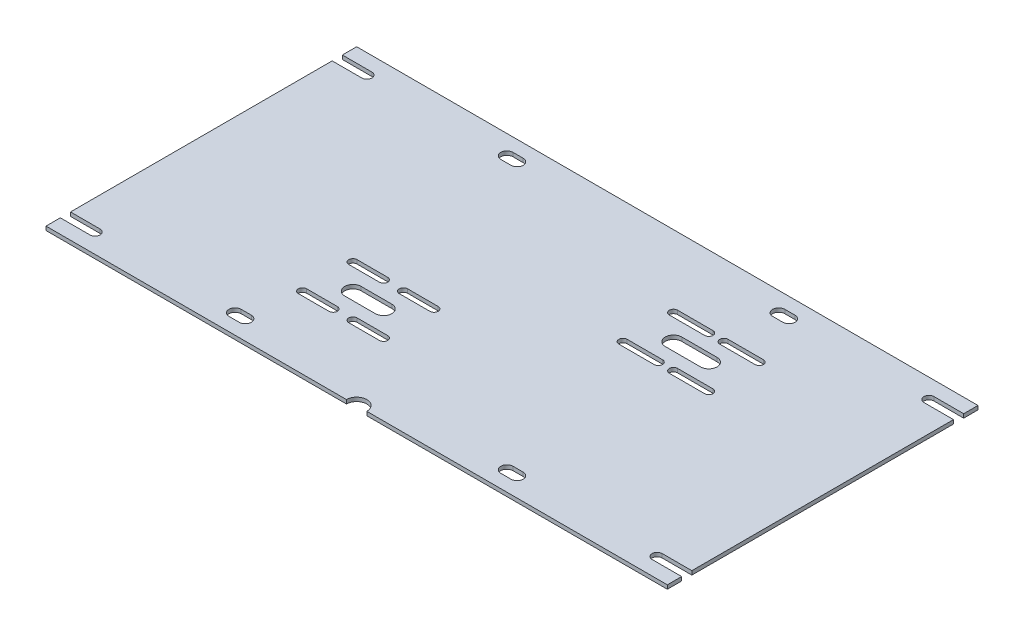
ISO-10303-21;
HEADER;
FILE_DESCRIPTION(('STEP AP214'),'2;1');
FILE_NAME('part.step','',(''),(''),'','','');
FILE_SCHEMA(('AUTOMOTIVE_DESIGN { 1 0 10303 214 1 1 1 1 }'));
ENDSEC;
DATA;
#1=APPLICATION_CONTEXT('core data for automotive mechanical design processes');
#2=APPLICATION_PROTOCOL_DEFINITION('international standard','automotive_design',2000,#1);
#3=PRODUCT_CONTEXT('',#1,'mechanical');
#4=PRODUCT('Part','Part','',(#3));
#5=PRODUCT_RELATED_PRODUCT_CATEGORY('part','',(#4));
#6=PRODUCT_DEFINITION_FORMATION('','',#4);
#7=PRODUCT_DEFINITION_CONTEXT('part definition',#1,'design');
#8=PRODUCT_DEFINITION('design','',#6,#7);
#9=PRODUCT_DEFINITION_SHAPE('','',#8);
#10=(LENGTH_UNIT() NAMED_UNIT(*) SI_UNIT(.MILLI.,.METRE.));
#11=(NAMED_UNIT(*) PLANE_ANGLE_UNIT() SI_UNIT($,.RADIAN.));
#12=(NAMED_UNIT(*) SI_UNIT($,.STERADIAN.) SOLID_ANGLE_UNIT());
#13=UNCERTAINTY_MEASURE_WITH_UNIT(LENGTH_MEASURE(1.E-05),#10,'distance_accuracy_value','');
#14=(GEOMETRIC_REPRESENTATION_CONTEXT(3) GLOBAL_UNCERTAINTY_ASSIGNED_CONTEXT((#13)) GLOBAL_UNIT_ASSIGNED_CONTEXT((#10,
#11,#12)) REPRESENTATION_CONTEXT('',''));
#15=CARTESIAN_POINT('',(0.,0.,0.));
#16=DIRECTION('',(0.,0.,1.));
#17=DIRECTION('',(1.,0.,0.));
#18=AXIS2_PLACEMENT_3D('',#15,#16,#17);
#19=CARTESIAN_POINT('',(-152.4,1.9,76.2));
#20=DIRECTION('',(0.,0.,-1.));
#21=DIRECTION('',(-1.,0.,0.));
#22=AXIS2_PLACEMENT_3D('',#19,#20,#21);
#23=PLANE('',#22);
#24=DIRECTION('',(1.,0.,0.));
#25=VECTOR('',#24,1.);
#26=CARTESIAN_POINT('',(-152.4,0.,76.2));
#27=LINE('',#26,#25);
#28=CARTESIAN_POINT('',(-152.4,0.,76.2));
#29=VERTEX_POINT('',#28);
#30=CARTESIAN_POINT('',(-5.00000000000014,0.,76.2));
#31=VERTEX_POINT('',#30);
#32=EDGE_CURVE('E562',#29,#31,#27,.T.);
#33=ORIENTED_EDGE('',*,*,#32,.T.);
#34=DIRECTION('',(0.,1.,0.));
#35=VECTOR('',#34,1.);
#36=CARTESIAN_POINT('',(-5.00000000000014,-8.1,76.2));
#37=LINE('',#36,#35);
#38=CARTESIAN_POINT('',(-5.00000000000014,1.9,76.2));
#39=VERTEX_POINT('',#38);
#40=EDGE_CURVE('E53',#31,#39,#37,.T.);
#41=ORIENTED_EDGE('',*,*,#40,.T.);
#42=DIRECTION('',(1.,0.,0.));
#43=VECTOR('',#42,1.);
#44=CARTESIAN_POINT('',(-152.4,1.9,76.2));
#45=LINE('',#44,#43);
#46=CARTESIAN_POINT('',(-152.4,1.9,76.2));
#47=VERTEX_POINT('',#46);
#48=EDGE_CURVE('E537',#47,#39,#45,.T.);
#49=ORIENTED_EDGE('',*,*,#48,.F.);
#50=DIRECTION('',(0.,-1.,0.));
#51=VECTOR('',#50,1.);
#52=CARTESIAN_POINT('',(-152.4,1.9,76.2));
#53=LINE('',#52,#51);
#54=EDGE_CURVE('E567',#47,#29,#53,.T.);
#55=ORIENTED_EDGE('',*,*,#54,.T.);
#56=EDGE_LOOP('',(#33,#41,#49,#55));
#57=FACE_BOUND('',#56,.T.);
#58=ADVANCED_FACE('F39',(#57),#23,.F.);
#59=CARTESIAN_POINT('',(152.4,1.9,-76.2));
#60=DIRECTION('',(-1.,0.,0.));
#61=DIRECTION('',(0.,0.,1.));
#62=AXIS2_PLACEMENT_3D('',#59,#60,#61);
#63=PLANE('',#62);
#64=DIRECTION('',(0.,0.,-1.));
#65=VECTOR('',#64,1.);
#66=CARTESIAN_POINT('',(152.4,1.9,-76.2));
#67=LINE('',#66,#65);
#68=CARTESIAN_POINT('',(152.4,1.9,-69.1750000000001));
#69=VERTEX_POINT('',#68);
#70=CARTESIAN_POINT('',(152.4,1.9,-76.2));
#71=VERTEX_POINT('',#70);
#72=EDGE_CURVE('E570',#69,#71,#67,.T.);
#73=ORIENTED_EDGE('',*,*,#72,.F.);
#74=DIRECTION('',(0.,1.,0.));
#75=VECTOR('',#74,1.);
#76=CARTESIAN_POINT('',(152.4,0.,-69.1750000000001));
#77=LINE('',#76,#75);
#78=CARTESIAN_POINT('',(152.4,0.,-69.1750000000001));
#79=VERTEX_POINT('',#78);
#80=EDGE_CURVE('E589',#79,#69,#77,.T.);
#81=ORIENTED_EDGE('',*,*,#80,.F.);
#82=DIRECTION('',(0.,0.,-1.));
#83=VECTOR('',#82,1.);
#84=CARTESIAN_POINT('',(152.4,0.,-76.2));
#85=LINE('',#84,#83);
#86=CARTESIAN_POINT('',(152.4,0.,-76.2));
#87=VERTEX_POINT('',#86);
#88=EDGE_CURVE('E558',#79,#87,#85,.T.);
#89=ORIENTED_EDGE('',*,*,#88,.T.);
#90=DIRECTION('',(0.,-1.,0.));
#91=VECTOR('',#90,1.);
#92=CARTESIAN_POINT('',(152.4,1.9,-76.2));
#93=LINE('',#92,#91);
#94=EDGE_CURVE('E50',#71,#87,#93,.T.);
#95=ORIENTED_EDGE('',*,*,#94,.F.);
#96=EDGE_LOOP('',(#73,#81,#89,#95));
#97=FACE_BOUND('',#96,.T.);
#98=ADVANCED_FACE('F583',(#97),#63,.F.);
#99=CARTESIAN_POINT('',(152.4,0.,64.1750000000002));
#100=VERTEX_POINT('',#99);
#101=CARTESIAN_POINT('',(152.4,0.,-64.1750000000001));
#102=VERTEX_POINT('',#101);
#103=EDGE_CURVE('E554',#100,#102,#85,.T.);
#104=ORIENTED_EDGE('',*,*,#103,.T.);
#105=DIRECTION('',(0.,1.,0.));
#106=VECTOR('',#105,1.);
#107=CARTESIAN_POINT('',(152.4,0.,-64.1750000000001));
#108=LINE('',#107,#106);
#109=CARTESIAN_POINT('',(152.4,1.9,-64.1750000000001));
#110=VERTEX_POINT('',#109);
#111=EDGE_CURVE('E748',#102,#110,#108,.T.);
#112=ORIENTED_EDGE('',*,*,#111,.T.);
#113=CARTESIAN_POINT('',(152.4,1.9,64.1750000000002));
#114=VERTEX_POINT('',#113);
#115=EDGE_CURVE('E609',#114,#110,#67,.T.);
#116=ORIENTED_EDGE('',*,*,#115,.F.);
#117=DIRECTION('',(0.,1.,0.));
#118=VECTOR('',#117,1.);
#119=CARTESIAN_POINT('',(152.4,0.,64.1750000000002));
#120=LINE('',#119,#118);
#121=EDGE_CURVE('E799',#100,#114,#120,.T.);
#122=ORIENTED_EDGE('',*,*,#121,.F.);
#123=EDGE_LOOP('',(#104,#112,#116,#122));
#124=FACE_BOUND('',#123,.T.);
#125=ADVANCED_FACE('F1175',(#124),#63,.F.);
#126=CARTESIAN_POINT('',(-152.4,1.9,-76.2));
#127=DIRECTION('',(1.,0.,0.));
#128=DIRECTION('',(0.,0.,-1.));
#129=AXIS2_PLACEMENT_3D('',#126,#127,#128);
#130=PLANE('',#129);
#131=DIRECTION('',(0.,0.,1.));
#132=VECTOR('',#131,1.);
#133=CARTESIAN_POINT('',(-152.4,1.9,-76.2));
#134=LINE('',#133,#132);
#135=CARTESIAN_POINT('',(-152.4,1.9,69.1749999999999));
#136=VERTEX_POINT('',#135);
#137=EDGE_CURVE('E547',#136,#47,#134,.T.);
#138=ORIENTED_EDGE('',*,*,#137,.F.);
#139=DIRECTION('',(0.,1.,0.));
#140=VECTOR('',#139,1.);
#141=CARTESIAN_POINT('',(-152.4,0.,69.1749999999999));
#142=LINE('',#141,#140);
#143=CARTESIAN_POINT('',(-152.4,0.,69.1749999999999));
#144=VERTEX_POINT('',#143);
#145=EDGE_CURVE('E772',#144,#136,#142,.T.);
#146=ORIENTED_EDGE('',*,*,#145,.F.);
#147=DIRECTION('',(0.,0.,1.));
#148=VECTOR('',#147,1.);
#149=CARTESIAN_POINT('',(-152.4,0.,-76.2));
#150=LINE('',#149,#148);
#151=EDGE_CURVE('E556',#144,#29,#150,.T.);
#152=ORIENTED_EDGE('',*,*,#151,.T.);
#153=ORIENTED_EDGE('',*,*,#54,.F.);
#154=EDGE_LOOP('',(#138,#146,#152,#153));
#155=FACE_BOUND('',#154,.T.);
#156=ADVANCED_FACE('F1207',(#155),#130,.F.);
#157=CARTESIAN_POINT('',(-152.4,0.,-64.175));
#158=VERTEX_POINT('',#157);
#159=CARTESIAN_POINT('',(-152.4,0.,64.1749999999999));
#160=VERTEX_POINT('',#159);
#161=EDGE_CURVE('E563',#158,#160,#150,.T.);
#162=ORIENTED_EDGE('',*,*,#161,.T.);
#163=DIRECTION('',(0.,1.,0.));
#164=VECTOR('',#163,1.);
#165=CARTESIAN_POINT('',(-152.4,0.,64.1749999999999));
#166=LINE('',#165,#164);
#167=CARTESIAN_POINT('',(-152.4,1.9,64.1749999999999));
#168=VERTEX_POINT('',#167);
#169=EDGE_CURVE('E771',#160,#168,#166,.T.);
#170=ORIENTED_EDGE('',*,*,#169,.T.);
#171=CARTESIAN_POINT('',(-152.4,1.9,-64.175));
#172=VERTEX_POINT('',#171);
#173=EDGE_CURVE('E548',#172,#168,#134,.T.);
#174=ORIENTED_EDGE('',*,*,#173,.F.);
#175=DIRECTION('',(0.,1.,0.));
#176=VECTOR('',#175,1.);
#177=CARTESIAN_POINT('',(-152.4,0.,-64.175));
#178=LINE('',#177,#176);
#179=EDGE_CURVE('E615',#158,#172,#178,.T.);
#180=ORIENTED_EDGE('',*,*,#179,.F.);
#181=EDGE_LOOP('',(#162,#170,#174,#180));
#182=FACE_BOUND('',#181,.T.);
#183=ADVANCED_FACE('F1211',(#182),#130,.F.);
#184=CARTESIAN_POINT('',(152.4,0.,76.2));
#185=VERTEX_POINT('',#184);
#186=CARTESIAN_POINT('',(152.4,0.,69.1750000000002));
#187=VERTEX_POINT('',#186);
#188=EDGE_CURVE('E553',#185,#187,#85,.T.);
#189=ORIENTED_EDGE('',*,*,#188,.T.);
#190=DIRECTION('',(0.,1.,0.));
#191=VECTOR('',#190,1.);
#192=CARTESIAN_POINT('',(152.4,0.,69.1750000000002));
#193=LINE('',#192,#191);
#194=CARTESIAN_POINT('',(152.4,1.9,69.1750000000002));
#195=VERTEX_POINT('',#194);
#196=EDGE_CURVE('E800',#187,#195,#193,.T.);
#197=ORIENTED_EDGE('',*,*,#196,.T.);
#198=CARTESIAN_POINT('',(152.4,1.9,76.2));
#199=VERTEX_POINT('',#198);
#200=EDGE_CURVE('E608',#199,#195,#67,.T.);
#201=ORIENTED_EDGE('',*,*,#200,.F.);
#202=DIRECTION('',(0.,-1.,0.));
#203=VECTOR('',#202,1.);
#204=CARTESIAN_POINT('',(152.4,1.9,76.2));
#205=LINE('',#204,#203);
#206=EDGE_CURVE('E543',#199,#185,#205,.T.);
#207=ORIENTED_EDGE('',*,*,#206,.T.);
#208=EDGE_LOOP('',(#189,#197,#201,#207));
#209=FACE_BOUND('',#208,.T.);
#210=ADVANCED_FACE('F41',(#209),#63,.F.);
#211=CARTESIAN_POINT('',(-152.4,1.9,-76.2));
#212=DIRECTION('',(0.,0.,1.));
#213=DIRECTION('',(1.,0.,0.));
#214=AXIS2_PLACEMENT_3D('',#211,#212,#213);
#215=PLANE('',#214);
#216=DIRECTION('',(-1.,0.,0.));
#217=VECTOR('',#216,1.);
#218=CARTESIAN_POINT('',(-152.4,0.,-76.2));
#219=LINE('',#218,#217);
#220=CARTESIAN_POINT('',(-152.4,0.,-76.2));
#221=VERTEX_POINT('',#220);
#222=EDGE_CURVE('E555',#87,#221,#219,.T.);
#223=ORIENTED_EDGE('',*,*,#222,.T.);
#224=DIRECTION('',(0.,-1.,0.));
#225=VECTOR('',#224,1.);
#226=CARTESIAN_POINT('',(-152.4,1.9,-76.2));
#227=LINE('',#226,#225);
#228=CARTESIAN_POINT('',(-152.4,1.9,-76.2));
#229=VERTEX_POINT('',#228);
#230=EDGE_CURVE('E575',#229,#221,#227,.T.);
#231=ORIENTED_EDGE('',*,*,#230,.F.);
#232=DIRECTION('',(-1.,0.,0.));
#233=VECTOR('',#232,1.);
#234=CARTESIAN_POINT('',(-152.4,1.9,-76.2));
#235=LINE('',#234,#233);
#236=EDGE_CURVE('E581',#71,#229,#235,.T.);
#237=ORIENTED_EDGE('',*,*,#236,.F.);
#238=ORIENTED_EDGE('',*,*,#94,.T.);
#239=EDGE_LOOP('',(#223,#231,#237,#238));
#240=FACE_BOUND('',#239,.T.);
#241=ADVANCED_FACE('F579',(#240),#215,.F.);
#242=CARTESIAN_POINT('',(-152.4,0.,-69.175));
#243=VERTEX_POINT('',#242);
#244=EDGE_CURVE('E559',#221,#243,#150,.T.);
#245=ORIENTED_EDGE('',*,*,#244,.T.);
#246=DIRECTION('',(0.,1.,0.));
#247=VECTOR('',#246,1.);
#248=CARTESIAN_POINT('',(-152.4,0.,-69.175));
#249=LINE('',#248,#247);
#250=CARTESIAN_POINT('',(-152.4,1.9,-69.175));
#251=VERTEX_POINT('',#250);
#252=EDGE_CURVE('E601',#243,#251,#249,.T.);
#253=ORIENTED_EDGE('',*,*,#252,.T.);
#254=EDGE_CURVE('E542',#229,#251,#134,.T.);
#255=ORIENTED_EDGE('',*,*,#254,.F.);
#256=ORIENTED_EDGE('',*,*,#230,.T.);
#257=EDGE_LOOP('',(#245,#253,#255,#256));
#258=FACE_BOUND('',#257,.T.);
#259=ADVANCED_FACE('F599',(#258),#130,.F.);
#260=CARTESIAN_POINT('',(4.99999999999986,1.9,76.2));
#261=VERTEX_POINT('',#260);
#262=EDGE_CURVE('E534',#261,#199,#45,.T.);
#263=ORIENTED_EDGE('',*,*,#262,.F.);
#264=DIRECTION('',(0.,1.,0.));
#265=VECTOR('',#264,1.);
#266=CARTESIAN_POINT('',(4.99999999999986,-8.1,76.2));
#267=LINE('',#266,#265);
#268=CARTESIAN_POINT('',(4.99999999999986,0.,76.2));
#269=VERTEX_POINT('',#268);
#270=EDGE_CURVE('E523',#261,#269,#267,.F.);
#271=ORIENTED_EDGE('',*,*,#270,.T.);
#272=EDGE_CURVE('E565',#269,#185,#27,.T.);
#273=ORIENTED_EDGE('',*,*,#272,.T.);
#274=ORIENTED_EDGE('',*,*,#206,.F.);
#275=EDGE_LOOP('',(#263,#271,#273,#274));
#276=FACE_BOUND('',#275,.T.);
#277=ADVANCED_FACE('F538',(#276),#23,.F.);
#278=CARTESIAN_POINT('',(0.,1.9,0.));
#279=DIRECTION('',(0.,1.,0.));
#280=DIRECTION('',(0.,0.,1.));
#281=AXIS2_PLACEMENT_3D('',#278,#279,#280);
#282=PLANE('',#281);
#283=CARTESIAN_POINT('',(-1.38777878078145E-13,1.9,76.2));
#284=DIRECTION('',(0.,1.,0.));
#285=DIRECTION('',(0.,0.,1.));
#286=AXIS2_PLACEMENT_3D('',#283,#284,#285);
#287=CIRCLE('',#286,5.);
#288=EDGE_CURVE('E525',#261,#39,#287,.T.);
#289=ORIENTED_EDGE('',*,*,#288,.F.);
#290=ORIENTED_EDGE('',*,*,#262,.T.);
#291=ORIENTED_EDGE('',*,*,#200,.T.);
#292=DIRECTION('',(1.,0.,0.));
#293=VECTOR('',#292,1.);
#294=CARTESIAN_POINT('',(152.4,1.9,69.1750000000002));
#295=LINE('',#294,#293);
#296=CARTESIAN_POINT('',(137.875,1.9,69.1750000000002));
#297=VERTEX_POINT('',#296);
#298=EDGE_CURVE('E791',#297,#195,#295,.T.);
#299=ORIENTED_EDGE('',*,*,#298,.F.);
#300=CARTESIAN_POINT('',(137.875,1.9,66.6750000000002));
#301=DIRECTION('',(0.,1.,0.));
#302=DIRECTION('',(0.,0.,1.));
#303=AXIS2_PLACEMENT_3D('',#300,#301,#302);
#304=CIRCLE('',#303,2.50000000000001);
#305=CARTESIAN_POINT('',(137.875,1.9,64.1750000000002));
#306=VERTEX_POINT('',#305);
#307=EDGE_CURVE('E790',#306,#297,#304,.T.);
#308=ORIENTED_EDGE('',*,*,#307,.F.);
#309=DIRECTION('',(-1.,0.,0.));
#310=VECTOR('',#309,1.);
#311=CARTESIAN_POINT('',(147.875,1.9,64.1750000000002));
#312=LINE('',#311,#310);
#313=EDGE_CURVE('E783',#114,#306,#312,.T.);
#314=ORIENTED_EDGE('',*,*,#313,.F.);
#315=ORIENTED_EDGE('',*,*,#115,.T.);
#316=DIRECTION('',(1.,0.,0.));
#317=VECTOR('',#316,1.);
#318=CARTESIAN_POINT('',(152.4,1.9,-64.1750000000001));
#319=LINE('',#318,#317);
#320=CARTESIAN_POINT('',(137.875,1.9,-64.1750000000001));
#321=VERTEX_POINT('',#320);
#322=EDGE_CURVE('E736',#321,#110,#319,.T.);
#323=ORIENTED_EDGE('',*,*,#322,.F.);
#324=CARTESIAN_POINT('',(137.875,1.9,-66.6750000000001));
#325=DIRECTION('',(0.,1.,0.));
#326=DIRECTION('',(0.,0.,-1.));
#327=AXIS2_PLACEMENT_3D('',#324,#325,#326);
#328=CIRCLE('',#327,2.50000000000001);
#329=CARTESIAN_POINT('',(137.875,1.9,-69.1750000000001));
#330=VERTEX_POINT('',#329);
#331=EDGE_CURVE('E657',#330,#321,#328,.T.);
#332=ORIENTED_EDGE('',*,*,#331,.F.);
#333=DIRECTION('',(-1.,0.,0.));
#334=VECTOR('',#333,1.);
#335=CARTESIAN_POINT('',(152.4,1.9,-69.1750000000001));
#336=LINE('',#335,#334);
#337=EDGE_CURVE('E731',#69,#330,#336,.T.);
#338=ORIENTED_EDGE('',*,*,#337,.F.);
#339=ORIENTED_EDGE('',*,*,#72,.T.);
#340=ORIENTED_EDGE('',*,*,#236,.T.);
#341=ORIENTED_EDGE('',*,*,#254,.T.);
#342=DIRECTION('',(-1.,0.,0.));
#343=VECTOR('',#342,1.);
#344=CARTESIAN_POINT('',(-152.4,1.9,-69.175));
#345=LINE('',#344,#343);
#346=CARTESIAN_POINT('',(-137.875,1.9,-69.175));
#347=VERTEX_POINT('',#346);
#348=EDGE_CURVE('E603',#347,#251,#345,.T.);
#349=ORIENTED_EDGE('',*,*,#348,.F.);
#350=CARTESIAN_POINT('',(-137.875,1.9,-66.675));
#351=DIRECTION('',(0.,1.,0.));
#352=DIRECTION('',(0.,0.,1.));
#353=AXIS2_PLACEMENT_3D('',#350,#351,#352);
#354=CIRCLE('',#353,2.50000000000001);
#355=CARTESIAN_POINT('',(-137.875,1.9,-64.175));
#356=VERTEX_POINT('',#355);
#357=EDGE_CURVE('E625',#356,#347,#354,.T.);
#358=ORIENTED_EDGE('',*,*,#357,.F.);
#359=DIRECTION('',(1.,0.,0.));
#360=VECTOR('',#359,1.);
#361=CARTESIAN_POINT('',(-147.875,1.9,-64.175));
#362=LINE('',#361,#360);
#363=EDGE_CURVE('E617',#172,#356,#362,.T.);
#364=ORIENTED_EDGE('',*,*,#363,.F.);
#365=ORIENTED_EDGE('',*,*,#173,.T.);
#366=DIRECTION('',(-1.,0.,0.));
#367=VECTOR('',#366,1.);
#368=CARTESIAN_POINT('',(-152.4,1.9,64.1749999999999));
#369=LINE('',#368,#367);
#370=CARTESIAN_POINT('',(-137.875,1.9,64.1749999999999));
#371=VERTEX_POINT('',#370);
#372=EDGE_CURVE('E764',#371,#168,#369,.T.);
#373=ORIENTED_EDGE('',*,*,#372,.F.);
#374=CARTESIAN_POINT('',(-137.875,1.9,66.6749999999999));
#375=DIRECTION('',(0.,1.,0.));
#376=DIRECTION('',(0.,0.,-1.));
#377=AXIS2_PLACEMENT_3D('',#374,#375,#376);
#378=CIRCLE('',#377,2.50000000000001);
#379=CARTESIAN_POINT('',(-137.875,1.9,69.1749999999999));
#380=VERTEX_POINT('',#379);
#381=EDGE_CURVE('E761',#380,#371,#378,.T.);
#382=ORIENTED_EDGE('',*,*,#381,.F.);
#383=DIRECTION('',(1.,0.,0.));
#384=VECTOR('',#383,1.);
#385=CARTESIAN_POINT('',(-152.4,1.9,69.1749999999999));
#386=LINE('',#385,#384);
#387=EDGE_CURVE('E751',#136,#380,#386,.T.);
#388=ORIENTED_EDGE('',*,*,#387,.F.);
#389=ORIENTED_EDGE('',*,*,#137,.T.);
#390=ORIENTED_EDGE('',*,*,#48,.T.);
#391=EDGE_LOOP('',(#289,#290,#291,#299,#308,#314,#315,#323,#332,#338,#339,#340,#341,#349,#358,
#364,#365,#373,#382,#388,#389,#390));
#392=FACE_BOUND('',#391,.T.);
#393=CARTESIAN_POINT('',(67.9684962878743,1.9,-28.575));
#394=DIRECTION('',(0.,1.,0.));
#395=DIRECTION('',(0.,0.,1.));
#396=AXIS2_PLACEMENT_3D('',#393,#394,#395);
#397=CIRCLE('',#396,4.05);
#398=CARTESIAN_POINT('',(67.9684962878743,1.9,-24.525));
#399=VERTEX_POINT('',#398);
#400=CARTESIAN_POINT('',(67.9684962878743,1.9,-32.625));
#401=VERTEX_POINT('',#400);
#402=EDGE_CURVE('E61',#399,#401,#397,.T.);
#403=ORIENTED_EDGE('',*,*,#402,.F.);
#404=DIRECTION('',(1.,0.,0.));
#405=VECTOR('',#404,1.);
#406=CARTESIAN_POINT('',(67.9684962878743,1.9,-24.525));
#407=LINE('',#406,#405);
#408=CARTESIAN_POINT('',(50.6482098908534,1.9,-24.525));
#409=VERTEX_POINT('',#408);
#410=EDGE_CURVE('E1093',#409,#399,#407,.T.);
#411=ORIENTED_EDGE('',*,*,#410,.F.);
#412=CARTESIAN_POINT('',(50.6482098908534,1.9,-28.575));
#413=DIRECTION('',(0.,1.,0.));
#414=DIRECTION('',(0.,0.,1.));
#415=AXIS2_PLACEMENT_3D('',#412,#413,#414);
#416=CIRCLE('',#415,4.05);
#417=CARTESIAN_POINT('',(50.6482098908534,1.9,-32.625));
#418=VERTEX_POINT('',#417);
#419=EDGE_CURVE('E1110',#418,#409,#416,.T.);
#420=ORIENTED_EDGE('',*,*,#419,.F.);
#421=DIRECTION('',(-1.,0.,0.));
#422=VECTOR('',#421,1.);
#423=CARTESIAN_POINT('',(67.9684962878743,1.9,-32.625));
#424=LINE('',#423,#422);
#425=EDGE_CURVE('E1108',#401,#418,#424,.T.);
#426=ORIENTED_EDGE('',*,*,#425,.F.);
#427=EDGE_LOOP('',(#403,#411,#420,#426));
#428=FACE_BOUND('',#427,.T.);
#429=CARTESIAN_POINT('',(55.5941276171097,1.9,-40.9493686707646));
#430=DIRECTION('',(0.,1.,0.));
#431=DIRECTION('',(0.,0.,1.));
#432=AXIS2_PLACEMENT_3D('',#429,#430,#431);
#433=CIRCLE('',#432,2.04999999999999);
#434=CARTESIAN_POINT('',(55.5941276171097,1.9,-38.8993686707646));
#435=VERTEX_POINT('',#434);
#436=CARTESIAN_POINT('',(55.5941276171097,1.9,-42.9993686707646));
#437=VERTEX_POINT('',#436);
#438=EDGE_CURVE('E1071',#435,#437,#433,.T.);
#439=ORIENTED_EDGE('',*,*,#438,.F.);
#440=DIRECTION('',(1.,0.,0.));
#441=VECTOR('',#440,1.);
#442=CARTESIAN_POINT('',(55.5941276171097,1.9,-38.8993686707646));
#443=LINE('',#442,#441);
#444=CARTESIAN_POINT('',(38.2738412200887,1.9,-38.8993686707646));
#445=VERTEX_POINT('',#444);
#446=EDGE_CURVE('E1064',#445,#435,#443,.T.);
#447=ORIENTED_EDGE('',*,*,#446,.F.);
#448=CARTESIAN_POINT('',(38.2738412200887,1.9,-40.9493686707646));
#449=DIRECTION('',(0.,1.,0.));
#450=DIRECTION('',(0.,0.,1.));
#451=AXIS2_PLACEMENT_3D('',#448,#449,#450);
#452=CIRCLE('',#451,2.04999999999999);
#453=CARTESIAN_POINT('',(38.2738412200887,1.9,-42.9993686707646));
#454=VERTEX_POINT('',#453);
#455=EDGE_CURVE('E1079',#454,#445,#452,.T.);
#456=ORIENTED_EDGE('',*,*,#455,.F.);
#457=DIRECTION('',(-1.,0.,0.));
#458=VECTOR('',#457,1.);
#459=CARTESIAN_POINT('',(55.5941276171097,1.9,-42.9993686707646));
#460=LINE('',#459,#458);
#461=EDGE_CURVE('E1078',#437,#454,#460,.T.);
#462=ORIENTED_EDGE('',*,*,#461,.F.);
#463=EDGE_LOOP('',(#439,#447,#456,#462));
#464=FACE_BOUND('',#463,.T.);
#465=CARTESIAN_POINT('',(80.3428649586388,1.9,-16.2006313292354));
#466=DIRECTION('',(0.,1.,0.));
#467=DIRECTION('',(0.,0.,1.));
#468=AXIS2_PLACEMENT_3D('',#465,#466,#467);
#469=CIRCLE('',#468,2.05000000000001);
#470=CARTESIAN_POINT('',(80.3428649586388,1.9,-14.1506313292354));
#471=VERTEX_POINT('',#470);
#472=CARTESIAN_POINT('',(80.3428649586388,1.9,-18.2506313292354));
#473=VERTEX_POINT('',#472);
#474=EDGE_CURVE('E1043',#471,#473,#469,.T.);
#475=ORIENTED_EDGE('',*,*,#474,.F.);
#476=DIRECTION('',(1.,0.,0.));
#477=VECTOR('',#476,1.);
#478=CARTESIAN_POINT('',(80.3428649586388,1.9,-14.1506313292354));
#479=LINE('',#478,#477);
#480=CARTESIAN_POINT('',(63.0225785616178,1.9,-14.1506313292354));
#481=VERTEX_POINT('',#480);
#482=EDGE_CURVE('E1029',#481,#471,#479,.T.);
#483=ORIENTED_EDGE('',*,*,#482,.F.);
#484=CARTESIAN_POINT('',(63.0225785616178,1.9,-16.2006313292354));
#485=DIRECTION('',(0.,1.,0.));
#486=DIRECTION('',(0.,0.,1.));
#487=AXIS2_PLACEMENT_3D('',#484,#485,#486);
#488=CIRCLE('',#487,2.04999999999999);
#489=CARTESIAN_POINT('',(63.0225785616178,1.9,-18.2506313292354));
#490=VERTEX_POINT('',#489);
#491=EDGE_CURVE('E1049',#490,#481,#488,.T.);
#492=ORIENTED_EDGE('',*,*,#491,.F.);
#493=DIRECTION('',(-1.,0.,0.));
#494=VECTOR('',#493,1.);
#495=CARTESIAN_POINT('',(80.3428649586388,1.9,-18.2506313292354));
#496=LINE('',#495,#494);
#497=EDGE_CURVE('E1045',#473,#490,#496,.T.);
#498=ORIENTED_EDGE('',*,*,#497,.F.);
#499=EDGE_LOOP('',(#475,#483,#492,#498));
#500=FACE_BOUND('',#499,.T.);
#501=CARTESIAN_POINT('',(55.5941276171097,1.9,-16.2006313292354));
#502=DIRECTION('',(0.,1.,0.));
#503=DIRECTION('',(0.,0.,1.));
#504=AXIS2_PLACEMENT_3D('',#501,#502,#503);
#505=CIRCLE('',#504,2.04999999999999);
#506=CARTESIAN_POINT('',(55.5941276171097,1.9,-14.1506313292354));
#507=VERTEX_POINT('',#506);
#508=CARTESIAN_POINT('',(55.5941276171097,1.9,-18.2506313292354));
#509=VERTEX_POINT('',#508);
#510=EDGE_CURVE('E1010',#507,#509,#505,.T.);
#511=ORIENTED_EDGE('',*,*,#510,.F.);
#512=DIRECTION('',(1.,0.,0.));
#513=VECTOR('',#512,1.);
#514=CARTESIAN_POINT('',(55.5941276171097,1.9,-14.1506313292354));
#515=LINE('',#514,#513);
#516=CARTESIAN_POINT('',(38.2738412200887,1.9,-14.1506313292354));
#517=VERTEX_POINT('',#516);
#518=EDGE_CURVE('E997',#517,#507,#515,.T.);
#519=ORIENTED_EDGE('',*,*,#518,.F.);
#520=CARTESIAN_POINT('',(38.2738412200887,1.9,-16.2006313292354));
#521=DIRECTION('',(0.,1.,0.));
#522=DIRECTION('',(0.,0.,1.));
#523=AXIS2_PLACEMENT_3D('',#520,#521,#522);
#524=CIRCLE('',#523,2.04999999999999);
#525=CARTESIAN_POINT('',(38.2738412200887,1.9,-18.2506313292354));
#526=VERTEX_POINT('',#525);
#527=EDGE_CURVE('E1012',#526,#517,#524,.T.);
#528=ORIENTED_EDGE('',*,*,#527,.F.);
#529=DIRECTION('',(-1.,0.,0.));
#530=VECTOR('',#529,1.);
#531=CARTESIAN_POINT('',(55.5941276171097,1.9,-18.2506313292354));
#532=LINE('',#531,#530);
#533=EDGE_CURVE('E1015',#509,#526,#532,.T.);
#534=ORIENTED_EDGE('',*,*,#533,.F.);
#535=EDGE_LOOP('',(#511,#519,#528,#534));
#536=FACE_BOUND('',#535,.T.);
#537=CARTESIAN_POINT('',(-46.7986622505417,1.9,16.2006313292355));
#538=DIRECTION('',(0.,1.,0.));
#539=DIRECTION('',(0.,0.,-1.));
#540=AXIS2_PLACEMENT_3D('',#537,#538,#539);
#541=CIRCLE('',#540,2.05);
#542=CARTESIAN_POINT('',(-46.7986622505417,1.9,18.2506313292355));
#543=VERTEX_POINT('',#542);
#544=CARTESIAN_POINT('',(-46.7986622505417,1.9,14.1506313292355));
#545=VERTEX_POINT('',#544);
#546=EDGE_CURVE('E979',#543,#545,#541,.T.);
#547=ORIENTED_EDGE('',*,*,#546,.F.);
#548=DIRECTION('',(1.,0.,0.));
#549=VECTOR('',#548,1.);
#550=CARTESIAN_POINT('',(-46.7986622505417,1.9,18.2506313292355));
#551=LINE('',#550,#549);
#552=CARTESIAN_POINT('',(-61.8306436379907,1.9,18.2506313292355));
#553=VERTEX_POINT('',#552);
#554=EDGE_CURVE('E967',#553,#543,#551,.T.);
#555=ORIENTED_EDGE('',*,*,#554,.F.);
#556=CARTESIAN_POINT('',(-61.8306436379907,1.9,16.2006313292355));
#557=DIRECTION('',(0.,1.,0.));
#558=DIRECTION('',(0.,0.,-1.));
#559=AXIS2_PLACEMENT_3D('',#556,#557,#558);
#560=CIRCLE('',#559,2.05);
#561=CARTESIAN_POINT('',(-61.8306436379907,1.9,14.1506313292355));
#562=VERTEX_POINT('',#561);
#563=EDGE_CURVE('E982',#562,#553,#560,.T.);
#564=ORIENTED_EDGE('',*,*,#563,.F.);
#565=DIRECTION('',(-1.,0.,0.));
#566=VECTOR('',#565,1.);
#567=CARTESIAN_POINT('',(-46.7986622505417,1.9,14.1506313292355));
#568=LINE('',#567,#566);
#569=EDGE_CURVE('E976',#545,#562,#568,.T.);
#570=ORIENTED_EDGE('',*,*,#569,.F.);
#571=EDGE_LOOP('',(#547,#555,#564,#570));
#572=FACE_BOUND('',#571,.T.);
#573=CARTESIAN_POINT('',(-22.0499249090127,1.9,16.2006313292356));
#574=DIRECTION('',(0.,1.,0.));
#575=DIRECTION('',(0.,0.,-1.));
#576=AXIS2_PLACEMENT_3D('',#573,#574,#575);
#577=CIRCLE('',#576,2.05);
#578=CARTESIAN_POINT('',(-22.0499249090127,1.9,18.2506313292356));
#579=VERTEX_POINT('',#578);
#580=CARTESIAN_POINT('',(-22.0499249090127,1.9,14.1506313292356));
#581=VERTEX_POINT('',#580);
#582=EDGE_CURVE('E944',#579,#581,#577,.T.);
#583=ORIENTED_EDGE('',*,*,#582,.F.);
#584=DIRECTION('',(1.,0.,0.));
#585=VECTOR('',#584,1.);
#586=CARTESIAN_POINT('',(-22.0499249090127,1.9,18.2506313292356));
#587=LINE('',#586,#585);
#588=CARTESIAN_POINT('',(-37.0819062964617,1.9,18.2506313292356));
#589=VERTEX_POINT('',#588);
#590=EDGE_CURVE('E935',#589,#579,#587,.T.);
#591=ORIENTED_EDGE('',*,*,#590,.F.);
#592=CARTESIAN_POINT('',(-37.0819062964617,1.9,16.2006313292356));
#593=DIRECTION('',(0.,1.,0.));
#594=DIRECTION('',(0.,0.,-1.));
#595=AXIS2_PLACEMENT_3D('',#592,#593,#594);
#596=CIRCLE('',#595,2.05);
#597=CARTESIAN_POINT('',(-37.0819062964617,1.9,14.1506313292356));
#598=VERTEX_POINT('',#597);
#599=EDGE_CURVE('E951',#598,#589,#596,.T.);
#600=ORIENTED_EDGE('',*,*,#599,.F.);
#601=DIRECTION('',(-1.,0.,0.));
#602=VECTOR('',#601,1.);
#603=CARTESIAN_POINT('',(-22.0499249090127,1.9,14.1506313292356));
#604=LINE('',#603,#602);
#605=EDGE_CURVE('E946',#581,#598,#604,.T.);
#606=ORIENTED_EDGE('',*,*,#605,.F.);
#607=EDGE_LOOP('',(#583,#591,#600,#606));
#608=FACE_BOUND('',#607,.T.);
#609=CARTESIAN_POINT('',(-34.4242935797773,1.9,28.575));
#610=DIRECTION('',(0.,1.,0.));
#611=DIRECTION('',(0.,0.,-1.));
#612=AXIS2_PLACEMENT_3D('',#609,#610,#611);
#613=CIRCLE('',#612,4.05);
#614=CARTESIAN_POINT('',(-34.4242935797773,1.9,32.625));
#615=VERTEX_POINT('',#614);
#616=CARTESIAN_POINT('',(-34.4242935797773,1.9,24.525));
#617=VERTEX_POINT('',#616);
#618=EDGE_CURVE('E912',#615,#617,#613,.T.);
#619=ORIENTED_EDGE('',*,*,#618,.F.);
#620=DIRECTION('',(1.,0.,0.));
#621=VECTOR('',#620,1.);
#622=CARTESIAN_POINT('',(-34.4242935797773,1.9,32.625));
#623=LINE('',#622,#621);
#624=CARTESIAN_POINT('',(-49.4562749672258,1.9,32.625));
#625=VERTEX_POINT('',#624);
#626=EDGE_CURVE('E905',#625,#615,#623,.T.);
#627=ORIENTED_EDGE('',*,*,#626,.F.);
#628=CARTESIAN_POINT('',(-49.4562749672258,1.9,28.575));
#629=DIRECTION('',(0.,1.,0.));
#630=DIRECTION('',(0.,0.,-1.));
#631=AXIS2_PLACEMENT_3D('',#628,#629,#630);
#632=CIRCLE('',#631,4.05);
#633=CARTESIAN_POINT('',(-49.4562749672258,1.9,24.525));
#634=VERTEX_POINT('',#633);
#635=EDGE_CURVE('E920',#634,#625,#632,.T.);
#636=ORIENTED_EDGE('',*,*,#635,.F.);
#637=DIRECTION('',(-1.,0.,0.));
#638=VECTOR('',#637,1.);
#639=CARTESIAN_POINT('',(-34.4242935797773,1.9,24.525));
#640=LINE('',#639,#638);
#641=EDGE_CURVE('E918',#617,#634,#640,.T.);
#642=ORIENTED_EDGE('',*,*,#641,.F.);
#643=EDGE_LOOP('',(#619,#627,#636,#642));
#644=FACE_BOUND('',#643,.T.);
#645=CARTESIAN_POINT('',(-22.0499249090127,1.9,40.9493686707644));
#646=DIRECTION('',(0.,1.,0.));
#647=DIRECTION('',(0.,0.,1.));
#648=AXIS2_PLACEMENT_3D('',#645,#646,#647);
#649=CIRCLE('',#648,2.05);
#650=CARTESIAN_POINT('',(-22.0499249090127,1.9,42.9993686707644));
#651=VERTEX_POINT('',#650);
#652=CARTESIAN_POINT('',(-22.0499249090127,1.9,38.8993686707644));
#653=VERTEX_POINT('',#652);
#654=EDGE_CURVE('E880',#651,#653,#649,.T.);
#655=ORIENTED_EDGE('',*,*,#654,.F.);
#656=DIRECTION('',(1.,0.,0.));
#657=VECTOR('',#656,1.);
#658=CARTESIAN_POINT('',(-22.0499249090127,1.9,42.9993686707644));
#659=LINE('',#658,#657);
#660=CARTESIAN_POINT('',(-37.0819062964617,1.9,42.9993686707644));
#661=VERTEX_POINT('',#660);
#662=EDGE_CURVE('E867',#661,#651,#659,.T.);
#663=ORIENTED_EDGE('',*,*,#662,.F.);
#664=CARTESIAN_POINT('',(-37.0819062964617,1.9,40.9493686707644));
#665=DIRECTION('',(0.,1.,0.));
#666=DIRECTION('',(0.,0.,1.));
#667=AXIS2_PLACEMENT_3D('',#664,#665,#666);
#668=CIRCLE('',#667,2.05);
#669=CARTESIAN_POINT('',(-37.0819062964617,1.9,38.8993686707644));
#670=VERTEX_POINT('',#669);
#671=EDGE_CURVE('E882',#670,#661,#668,.T.);
#672=ORIENTED_EDGE('',*,*,#671,.F.);
#673=DIRECTION('',(-1.,0.,0.));
#674=VECTOR('',#673,1.);
#675=CARTESIAN_POINT('',(-22.0499249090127,1.9,38.8993686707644));
#676=LINE('',#675,#674);
#677=EDGE_CURVE('E885',#653,#670,#676,.T.);
#678=ORIENTED_EDGE('',*,*,#677,.F.);
#679=EDGE_LOOP('',(#655,#663,#672,#678));
#680=FACE_BOUND('',#679,.T.);
#681=CARTESIAN_POINT('',(-46.7986622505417,1.9,40.9493686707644));
#682=DIRECTION('',(0.,1.,0.));
#683=DIRECTION('',(0.,0.,1.));
#684=AXIS2_PLACEMENT_3D('',#681,#682,#683);
#685=CIRCLE('',#684,2.05);
#686=CARTESIAN_POINT('',(-46.7986622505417,1.9,42.9993686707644));
#687=VERTEX_POINT('',#686);
#688=CARTESIAN_POINT('',(-46.7986622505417,1.9,38.8993686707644));
#689=VERTEX_POINT('',#688);
#690=EDGE_CURVE('E893',#687,#689,#685,.T.);
#691=ORIENTED_EDGE('',*,*,#690,.F.);
#692=DIRECTION('',(1.,0.,0.));
#693=VECTOR('',#692,1.);
#694=CARTESIAN_POINT('',(-46.7986622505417,1.9,42.9993686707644));
#695=LINE('',#694,#693);
#696=CARTESIAN_POINT('',(-61.8306436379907,1.9,42.9993686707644));
#697=VERTEX_POINT('',#696);
#698=EDGE_CURVE('E1124',#697,#687,#695,.T.);
#699=ORIENTED_EDGE('',*,*,#698,.F.);
#700=CARTESIAN_POINT('',(-61.8306436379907,1.9,40.9493686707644));
#701=DIRECTION('',(0.,1.,0.));
#702=DIRECTION('',(0.,0.,1.));
#703=AXIS2_PLACEMENT_3D('',#700,#701,#702);
#704=CIRCLE('',#703,2.05);
#705=CARTESIAN_POINT('',(-61.8306436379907,1.9,38.8993686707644));
#706=VERTEX_POINT('',#705);
#707=EDGE_CURVE('E1136',#706,#697,#704,.T.);
#708=ORIENTED_EDGE('',*,*,#707,.F.);
#709=DIRECTION('',(-1.,0.,0.));
#710=VECTOR('',#709,1.);
#711=CARTESIAN_POINT('',(-46.7986622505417,1.9,38.8993686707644));
#712=LINE('',#711,#710);
#713=EDGE_CURVE('E1131',#689,#706,#712,.T.);
#714=ORIENTED_EDGE('',*,*,#713,.F.);
#715=EDGE_LOOP('',(#691,#699,#708,#714));
#716=FACE_BOUND('',#715,.T.);
#717=CARTESIAN_POINT('',(80.3428649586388,1.9,-40.9493686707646));
#718=DIRECTION('',(0.,1.,0.));
#719=DIRECTION('',(0.,0.,1.));
#720=AXIS2_PLACEMENT_3D('',#717,#718,#719);
#721=CIRCLE('',#720,2.05);
#722=CARTESIAN_POINT('',(80.3428649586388,1.9,-38.8993686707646));
#723=VERTEX_POINT('',#722);
#724=CARTESIAN_POINT('',(80.3428649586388,1.9,-42.9993686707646));
#725=VERTEX_POINT('',#724);
#726=EDGE_CURVE('E852',#723,#725,#721,.T.);
#727=ORIENTED_EDGE('',*,*,#726,.F.);
#728=DIRECTION('',(1.,0.,0.));
#729=VECTOR('',#728,1.);
#730=CARTESIAN_POINT('',(80.3428649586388,1.9,-38.8993686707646));
#731=LINE('',#730,#729);
#732=CARTESIAN_POINT('',(63.0225785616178,1.9,-38.8993686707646));
#733=VERTEX_POINT('',#732);
#734=EDGE_CURVE('E844',#733,#723,#731,.T.);
#735=ORIENTED_EDGE('',*,*,#734,.F.);
#736=CARTESIAN_POINT('',(63.0225785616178,1.9,-40.9493686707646));
#737=DIRECTION('',(0.,1.,0.));
#738=DIRECTION('',(0.,0.,1.));
#739=AXIS2_PLACEMENT_3D('',#736,#737,#738);
#740=CIRCLE('',#739,2.05000000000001);
#741=CARTESIAN_POINT('',(63.0225785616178,1.9,-42.9993686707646));
#742=VERTEX_POINT('',#741);
#743=EDGE_CURVE('E849',#742,#733,#740,.T.);
#744=ORIENTED_EDGE('',*,*,#743,.F.);
#745=DIRECTION('',(-1.,0.,0.));
#746=VECTOR('',#745,1.);
#747=CARTESIAN_POINT('',(80.3428649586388,1.9,-42.9993686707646));
#748=LINE('',#747,#746);
#749=EDGE_CURVE('E846',#725,#742,#748,.T.);
#750=ORIENTED_EDGE('',*,*,#749,.F.);
#751=EDGE_LOOP('',(#727,#735,#744,#750));
#752=FACE_BOUND('',#751,.T.);
#753=CARTESIAN_POINT('',(-69.1750000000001,1.9,66.675));
#754=DIRECTION('',(0.,1.,0.));
#755=DIRECTION('',(0.,0.,-1.));
#756=AXIS2_PLACEMENT_3D('',#753,#754,#755);
#757=CIRCLE('',#756,2.99999999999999);
#758=CARTESIAN_POINT('',(-69.1750000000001,1.9,63.675));
#759=VERTEX_POINT('',#758);
#760=CARTESIAN_POINT('',(-69.1750000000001,1.9,69.675));
#761=VERTEX_POINT('',#760);
#762=EDGE_CURVE('E709',#759,#761,#757,.T.);
#763=ORIENTED_EDGE('',*,*,#762,.F.);
#764=DIRECTION('',(-1.,0.,0.));
#765=VECTOR('',#764,1.);
#766=CARTESIAN_POINT('',(-69.1750000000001,1.9,63.675));
#767=LINE('',#766,#765);
#768=CARTESIAN_POINT('',(-64.175,1.9,63.675));
#769=VERTEX_POINT('',#768);
#770=EDGE_CURVE('E700',#769,#759,#767,.T.);
#771=ORIENTED_EDGE('',*,*,#770,.F.);
#772=CARTESIAN_POINT('',(-64.175,1.9,66.675));
#773=DIRECTION('',(0.,1.,0.));
#774=DIRECTION('',(0.,0.,-1.));
#775=AXIS2_PLACEMENT_3D('',#772,#773,#774);
#776=CIRCLE('',#775,2.99999999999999);
#777=CARTESIAN_POINT('',(-64.175,1.9,69.675));
#778=VERTEX_POINT('',#777);
#779=EDGE_CURVE('E713',#778,#769,#776,.T.);
#780=ORIENTED_EDGE('',*,*,#779,.F.);
#781=DIRECTION('',(1.,0.,0.));
#782=VECTOR('',#781,1.);
#783=CARTESIAN_POINT('',(-69.1750000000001,1.9,69.675));
#784=LINE('',#783,#782);
#785=EDGE_CURVE('E711',#761,#778,#784,.T.);
#786=ORIENTED_EDGE('',*,*,#785,.F.);
#787=EDGE_LOOP('',(#763,#771,#780,#786));
#788=FACE_BOUND('',#787,.T.);
#789=CARTESIAN_POINT('',(69.1750000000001,1.9,-66.675));
#790=DIRECTION('',(0.,1.,0.));
#791=DIRECTION('',(0.,0.,-1.));
#792=AXIS2_PLACEMENT_3D('',#789,#790,#791);
#793=CIRCLE('',#792,2.99999999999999);
#794=CARTESIAN_POINT('',(69.1750000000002,1.9,-63.675));
#795=VERTEX_POINT('',#794);
#796=CARTESIAN_POINT('',(69.1750000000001,1.9,-69.675));
#797=VERTEX_POINT('',#796);
#798=EDGE_CURVE('E641',#795,#797,#793,.T.);
#799=ORIENTED_EDGE('',*,*,#798,.F.);
#800=DIRECTION('',(1.,0.,0.));
#801=VECTOR('',#800,1.);
#802=CARTESIAN_POINT('',(69.1750000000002,1.9,-63.675));
#803=LINE('',#802,#801);
#804=CARTESIAN_POINT('',(64.1749999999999,1.9,-63.675));
#805=VERTEX_POINT('',#804);
#806=EDGE_CURVE('E633',#805,#795,#803,.T.);
#807=ORIENTED_EDGE('',*,*,#806,.F.);
#808=CARTESIAN_POINT('',(64.1750000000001,1.9,-66.675));
#809=DIRECTION('',(0.,1.,0.));
#810=DIRECTION('',(0.,0.,-1.));
#811=AXIS2_PLACEMENT_3D('',#808,#809,#810);
#812=CIRCLE('',#811,2.99999999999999);
#813=CARTESIAN_POINT('',(64.1750000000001,1.9,-69.675));
#814=VERTEX_POINT('',#813);
#815=EDGE_CURVE('E650',#814,#805,#812,.T.);
#816=ORIENTED_EDGE('',*,*,#815,.F.);
#817=DIRECTION('',(-1.,0.,0.));
#818=VECTOR('',#817,1.);
#819=CARTESIAN_POINT('',(69.1750000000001,1.9,-69.675));
#820=LINE('',#819,#818);
#821=EDGE_CURVE('E647',#797,#814,#820,.T.);
#822=ORIENTED_EDGE('',*,*,#821,.F.);
#823=EDGE_LOOP('',(#799,#807,#816,#822));
#824=FACE_BOUND('',#823,.T.);
#825=CARTESIAN_POINT('',(-69.1750000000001,1.9,-66.675));
#826=DIRECTION('',(0.,1.,0.));
#827=DIRECTION('',(0.,0.,1.));
#828=AXIS2_PLACEMENT_3D('',#825,#826,#827);
#829=CIRCLE('',#828,2.99999999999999);
#830=CARTESIAN_POINT('',(-69.1750000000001,1.9,-69.675));
#831=VERTEX_POINT('',#830);
#832=CARTESIAN_POINT('',(-69.1750000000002,1.9,-63.675));
#833=VERTEX_POINT('',#832);
#834=EDGE_CURVE('E622',#831,#833,#829,.T.);
#835=ORIENTED_EDGE('',*,*,#834,.F.);
#836=DIRECTION('',(-1.,0.,0.));
#837=VECTOR('',#836,1.);
#838=CARTESIAN_POINT('',(-69.1750000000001,1.9,-69.675));
#839=LINE('',#838,#837);
#840=CARTESIAN_POINT('',(-64.1750000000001,1.9,-69.675));
#841=VERTEX_POINT('',#840);
#842=EDGE_CURVE('E667',#841,#831,#839,.T.);
#843=ORIENTED_EDGE('',*,*,#842,.F.);
#844=CARTESIAN_POINT('',(-64.1750000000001,1.9,-66.675));
#845=DIRECTION('',(0.,1.,0.));
#846=DIRECTION('',(0.,0.,1.));
#847=AXIS2_PLACEMENT_3D('',#844,#845,#846);
#848=CIRCLE('',#847,2.99999999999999);
#849=CARTESIAN_POINT('',(-64.1749999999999,1.9,-63.675));
#850=VERTEX_POINT('',#849);
#851=EDGE_CURVE('E682',#850,#841,#848,.T.);
#852=ORIENTED_EDGE('',*,*,#851,.F.);
#853=DIRECTION('',(1.,0.,0.));
#854=VECTOR('',#853,1.);
#855=CARTESIAN_POINT('',(-69.1750000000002,1.9,-63.675));
#856=LINE('',#855,#854);
#857=EDGE_CURVE('E680',#833,#850,#856,.T.);
#858=ORIENTED_EDGE('',*,*,#857,.F.);
#859=EDGE_LOOP('',(#835,#843,#852,#858));
#860=FACE_BOUND('',#859,.T.);
#861=CARTESIAN_POINT('',(69.1750000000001,1.9,66.675));
#862=DIRECTION('',(0.,1.,0.));
#863=DIRECTION('',(0.,0.,1.));
#864=AXIS2_PLACEMENT_3D('',#861,#862,#863);
#865=CIRCLE('',#864,2.99999999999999);
#866=CARTESIAN_POINT('',(69.1750000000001,1.9,69.675));
#867=VERTEX_POINT('',#866);
#868=CARTESIAN_POINT('',(69.1750000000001,1.9,63.675));
#869=VERTEX_POINT('',#868);
#870=EDGE_CURVE('E724',#867,#869,#865,.T.);
#871=ORIENTED_EDGE('',*,*,#870,.F.);
#872=DIRECTION('',(1.,0.,0.));
#873=VECTOR('',#872,1.);
#874=CARTESIAN_POINT('',(69.1750000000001,1.9,69.675));
#875=LINE('',#874,#873);
#876=CARTESIAN_POINT('',(64.175,1.9,69.675));
#877=VERTEX_POINT('',#876);
#878=EDGE_CURVE('E809',#877,#867,#875,.T.);
#879=ORIENTED_EDGE('',*,*,#878,.F.);
#880=CARTESIAN_POINT('',(64.175,1.9,66.675));
#881=DIRECTION('',(0.,1.,0.));
#882=DIRECTION('',(0.,0.,1.));
#883=AXIS2_PLACEMENT_3D('',#880,#881,#882);
#884=CIRCLE('',#883,2.99999999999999);
#885=CARTESIAN_POINT('',(64.175,1.9,63.675));
#886=VERTEX_POINT('',#885);
#887=EDGE_CURVE('E825',#886,#877,#884,.T.);
#888=ORIENTED_EDGE('',*,*,#887,.F.);
#889=DIRECTION('',(-1.,0.,0.));
#890=VECTOR('',#889,1.);
#891=CARTESIAN_POINT('',(69.1750000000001,1.9,63.675));
#892=LINE('',#891,#890);
#893=EDGE_CURVE('E819',#869,#886,#892,.T.);
#894=ORIENTED_EDGE('',*,*,#893,.F.);
#895=EDGE_LOOP('',(#871,#879,#888,#894));
#896=FACE_BOUND('',#895,.T.);
#897=ADVANCED_FACE('F532',(#392,#428,#464,#500,#536,#572,#608,#644,#680,#716,#752,#788,#824,
#860,#896),#282,.T.);
#898=CARTESIAN_POINT('',(0.,0.,0.));
#899=DIRECTION('',(0.,1.,0.));
#900=DIRECTION('',(0.,0.,1.));
#901=AXIS2_PLACEMENT_3D('',#898,#899,#900);
#902=PLANE('',#901);
#903=DIRECTION('',(1.,0.,0.));
#904=VECTOR('',#903,1.);
#905=CARTESIAN_POINT('',(67.9684962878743,0.,-24.525));
#906=LINE('',#905,#904);
#907=CARTESIAN_POINT('',(50.6482098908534,0.,-24.525));
#908=VERTEX_POINT('',#907);
#909=CARTESIAN_POINT('',(67.9684962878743,0.,-24.525));
#910=VERTEX_POINT('',#909);
#911=EDGE_CURVE('E1101',#908,#910,#906,.T.);
#912=ORIENTED_EDGE('',*,*,#911,.T.);
#913=CARTESIAN_POINT('',(67.9684962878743,0.,-28.575));
#914=DIRECTION('',(0.,1.,0.));
#915=DIRECTION('',(0.,0.,1.));
#916=AXIS2_PLACEMENT_3D('',#913,#914,#915);
#917=CIRCLE('',#916,4.05);
#918=CARTESIAN_POINT('',(67.9684962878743,0.,-32.625));
#919=VERTEX_POINT('',#918);
#920=EDGE_CURVE('E1091',#910,#919,#917,.T.);
#921=ORIENTED_EDGE('',*,*,#920,.T.);
#922=DIRECTION('',(-1.,0.,0.));
#923=VECTOR('',#922,1.);
#924=CARTESIAN_POINT('',(67.9684962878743,0.,-32.625));
#925=LINE('',#924,#923);
#926=CARTESIAN_POINT('',(50.6482098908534,0.,-32.625));
#927=VERTEX_POINT('',#926);
#928=EDGE_CURVE('E1094',#919,#927,#925,.T.);
#929=ORIENTED_EDGE('',*,*,#928,.T.);
#930=CARTESIAN_POINT('',(50.6482098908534,0.,-28.575));
#931=DIRECTION('',(0.,1.,0.));
#932=DIRECTION('',(0.,0.,1.));
#933=AXIS2_PLACEMENT_3D('',#930,#931,#932);
#934=CIRCLE('',#933,4.05);
#935=EDGE_CURVE('E1099',#927,#908,#934,.T.);
#936=ORIENTED_EDGE('',*,*,#935,.T.);
#937=EDGE_LOOP('',(#912,#921,#929,#936));
#938=FACE_BOUND('',#937,.T.);
#939=DIRECTION('',(1.,0.,0.));
#940=VECTOR('',#939,1.);
#941=CARTESIAN_POINT('',(55.5941276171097,0.,-38.8993686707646));
#942=LINE('',#941,#940);
#943=CARTESIAN_POINT('',(38.2738412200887,0.,-38.8993686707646));
#944=VERTEX_POINT('',#943);
#945=CARTESIAN_POINT('',(55.5941276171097,0.,-38.8993686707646));
#946=VERTEX_POINT('',#945);
#947=EDGE_CURVE('E1070',#944,#946,#942,.T.);
#948=ORIENTED_EDGE('',*,*,#947,.T.);
#949=CARTESIAN_POINT('',(55.5941276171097,0.,-40.9493686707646));
#950=DIRECTION('',(0.,1.,0.));
#951=DIRECTION('',(0.,0.,1.));
#952=AXIS2_PLACEMENT_3D('',#949,#950,#951);
#953=CIRCLE('',#952,2.04999999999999);
#954=CARTESIAN_POINT('',(55.5941276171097,0.,-42.9993686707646));
#955=VERTEX_POINT('',#954);
#956=EDGE_CURVE('E1058',#946,#955,#953,.T.);
#957=ORIENTED_EDGE('',*,*,#956,.T.);
#958=DIRECTION('',(-1.,0.,0.));
#959=VECTOR('',#958,1.);
#960=CARTESIAN_POINT('',(55.5941276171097,0.,-42.9993686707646));
#961=LINE('',#960,#959);
#962=CARTESIAN_POINT('',(38.2738412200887,0.,-42.9993686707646));
#963=VERTEX_POINT('',#962);
#964=EDGE_CURVE('E1062',#955,#963,#961,.T.);
#965=ORIENTED_EDGE('',*,*,#964,.T.);
#966=CARTESIAN_POINT('',(38.2738412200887,0.,-40.9493686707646));
#967=DIRECTION('',(0.,1.,0.));
#968=DIRECTION('',(0.,0.,1.));
#969=AXIS2_PLACEMENT_3D('',#966,#967,#968);
#970=CIRCLE('',#969,2.04999999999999);
#971=EDGE_CURVE('E1068',#963,#944,#970,.T.);
#972=ORIENTED_EDGE('',*,*,#971,.T.);
#973=EDGE_LOOP('',(#948,#957,#965,#972));
#974=FACE_BOUND('',#973,.T.);
#975=DIRECTION('',(1.,0.,0.));
#976=VECTOR('',#975,1.);
#977=CARTESIAN_POINT('',(80.3428649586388,0.,-14.1506313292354));
#978=LINE('',#977,#976);
#979=CARTESIAN_POINT('',(63.0225785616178,0.,-14.1506313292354));
#980=VERTEX_POINT('',#979);
#981=CARTESIAN_POINT('',(80.3428649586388,0.,-14.1506313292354));
#982=VERTEX_POINT('',#981);
#983=EDGE_CURVE('E1037',#980,#982,#978,.T.);
#984=ORIENTED_EDGE('',*,*,#983,.T.);
#985=CARTESIAN_POINT('',(80.3428649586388,0.,-16.2006313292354));
#986=DIRECTION('',(0.,1.,0.));
#987=DIRECTION('',(0.,0.,1.));
#988=AXIS2_PLACEMENT_3D('',#985,#986,#987);
#989=CIRCLE('',#988,2.05000000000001);
#990=CARTESIAN_POINT('',(80.3428649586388,0.,-18.2506313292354));
#991=VERTEX_POINT('',#990);
#992=EDGE_CURVE('E1030',#982,#991,#989,.T.);
#993=ORIENTED_EDGE('',*,*,#992,.T.);
#994=DIRECTION('',(-1.,0.,0.));
#995=VECTOR('',#994,1.);
#996=CARTESIAN_POINT('',(80.3428649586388,0.,-18.2506313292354));
#997=LINE('',#996,#995);
#998=CARTESIAN_POINT('',(63.0225785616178,0.,-18.2506313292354));
#999=VERTEX_POINT('',#998);
#1000=EDGE_CURVE('E1032',#991,#999,#997,.T.);
#1001=ORIENTED_EDGE('',*,*,#1000,.T.);
#1002=CARTESIAN_POINT('',(63.0225785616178,0.,-16.2006313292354));
#1003=DIRECTION('',(0.,1.,0.));
#1004=DIRECTION('',(0.,0.,1.));
#1005=AXIS2_PLACEMENT_3D('',#1002,#1003,#1004);
#1006=CIRCLE('',#1005,2.04999999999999);
#1007=EDGE_CURVE('E1031',#999,#980,#1006,.T.);
#1008=ORIENTED_EDGE('',*,*,#1007,.T.);
#1009=EDGE_LOOP('',(#984,#993,#1001,#1008));
#1010=FACE_BOUND('',#1009,.T.);
#1011=DIRECTION('',(1.,0.,0.));
#1012=VECTOR('',#1011,1.);
#1013=CARTESIAN_POINT('',(55.5941276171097,0.,-14.1506313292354));
#1014=LINE('',#1013,#1012);
#1015=CARTESIAN_POINT('',(38.2738412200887,0.,-14.1506313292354));
#1016=VERTEX_POINT('',#1015);
#1017=CARTESIAN_POINT('',(55.5941276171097,0.,-14.1506313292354));
#1018=VERTEX_POINT('',#1017);
#1019=EDGE_CURVE('E1001',#1016,#1018,#1014,.T.);
#1020=ORIENTED_EDGE('',*,*,#1019,.T.);
#1021=CARTESIAN_POINT('',(55.5941276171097,0.,-16.2006313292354));
#1022=DIRECTION('',(0.,1.,0.));
#1023=DIRECTION('',(0.,0.,1.));
#1024=AXIS2_PLACEMENT_3D('',#1021,#1022,#1023);
#1025=CIRCLE('',#1024,2.04999999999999);
#1026=CARTESIAN_POINT('',(55.5941276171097,0.,-18.2506313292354));
#1027=VERTEX_POINT('',#1026);
#1028=EDGE_CURVE('E995',#1018,#1027,#1025,.T.);
#1029=ORIENTED_EDGE('',*,*,#1028,.T.);
#1030=DIRECTION('',(-1.,0.,0.));
#1031=VECTOR('',#1030,1.);
#1032=CARTESIAN_POINT('',(55.5941276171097,0.,-18.2506313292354));
#1033=LINE('',#1032,#1031);
#1034=CARTESIAN_POINT('',(38.2738412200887,0.,-18.2506313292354));
#1035=VERTEX_POINT('',#1034);
#1036=EDGE_CURVE('E1000',#1027,#1035,#1033,.T.);
#1037=ORIENTED_EDGE('',*,*,#1036,.T.);
#1038=CARTESIAN_POINT('',(38.2738412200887,0.,-16.2006313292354));
#1039=DIRECTION('',(0.,1.,0.));
#1040=DIRECTION('',(0.,0.,1.));
#1041=AXIS2_PLACEMENT_3D('',#1038,#1039,#1040);
#1042=CIRCLE('',#1041,2.04999999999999);
#1043=EDGE_CURVE('E1004',#1035,#1016,#1042,.T.);
#1044=ORIENTED_EDGE('',*,*,#1043,.T.);
#1045=EDGE_LOOP('',(#1020,#1029,#1037,#1044));
#1046=FACE_BOUND('',#1045,.T.);
#1047=DIRECTION('',(1.,0.,0.));
#1048=VECTOR('',#1047,1.);
#1049=CARTESIAN_POINT('',(-46.7986622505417,0.,18.2506313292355));
#1050=LINE('',#1049,#1048);
#1051=CARTESIAN_POINT('',(-61.8306436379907,0.,18.2506313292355));
#1052=VERTEX_POINT('',#1051);
#1053=CARTESIAN_POINT('',(-46.7986622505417,0.,18.2506313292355));
#1054=VERTEX_POINT('',#1053);
#1055=EDGE_CURVE('E974',#1052,#1054,#1050,.T.);
#1056=ORIENTED_EDGE('',*,*,#1055,.T.);
#1057=CARTESIAN_POINT('',(-46.7986622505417,0.,16.2006313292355));
#1058=DIRECTION('',(0.,1.,0.));
#1059=DIRECTION('',(0.,0.,-1.));
#1060=AXIS2_PLACEMENT_3D('',#1057,#1058,#1059);
#1061=CIRCLE('',#1060,2.05);
#1062=CARTESIAN_POINT('',(-46.7986622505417,0.,14.1506313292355));
#1063=VERTEX_POINT('',#1062);
#1064=EDGE_CURVE('E962',#1054,#1063,#1061,.T.);
#1065=ORIENTED_EDGE('',*,*,#1064,.T.);
#1066=DIRECTION('',(-1.,0.,0.));
#1067=VECTOR('',#1066,1.);
#1068=CARTESIAN_POINT('',(-46.7986622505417,0.,14.1506313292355));
#1069=LINE('',#1068,#1067);
#1070=CARTESIAN_POINT('',(-61.8306436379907,0.,14.1506313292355));
#1071=VERTEX_POINT('',#1070);
#1072=EDGE_CURVE('E970',#1063,#1071,#1069,.T.);
#1073=ORIENTED_EDGE('',*,*,#1072,.T.);
#1074=CARTESIAN_POINT('',(-61.8306436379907,0.,16.2006313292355));
#1075=DIRECTION('',(0.,1.,0.));
#1076=DIRECTION('',(0.,0.,-1.));
#1077=AXIS2_PLACEMENT_3D('',#1074,#1075,#1076);
#1078=CIRCLE('',#1077,2.05);
#1079=EDGE_CURVE('E968',#1071,#1052,#1078,.T.);
#1080=ORIENTED_EDGE('',*,*,#1079,.T.);
#1081=EDGE_LOOP('',(#1056,#1065,#1073,#1080));
#1082=FACE_BOUND('',#1081,.T.);
#1083=DIRECTION('',(1.,0.,0.));
#1084=VECTOR('',#1083,1.);
#1085=CARTESIAN_POINT('',(-22.0499249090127,0.,18.2506313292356));
#1086=LINE('',#1085,#1084);
#1087=CARTESIAN_POINT('',(-37.0819062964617,0.,18.2506313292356));
#1088=VERTEX_POINT('',#1087);
#1089=CARTESIAN_POINT('',(-22.0499249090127,0.,18.2506313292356));
#1090=VERTEX_POINT('',#1089);
#1091=EDGE_CURVE('E943',#1088,#1090,#1086,.T.);
#1092=ORIENTED_EDGE('',*,*,#1091,.T.);
#1093=CARTESIAN_POINT('',(-22.0499249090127,0.,16.2006313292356));
#1094=DIRECTION('',(0.,1.,0.));
#1095=DIRECTION('',(0.,0.,-1.));
#1096=AXIS2_PLACEMENT_3D('',#1093,#1094,#1095);
#1097=CIRCLE('',#1096,2.05);
#1098=CARTESIAN_POINT('',(-22.0499249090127,0.,14.1506313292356));
#1099=VERTEX_POINT('',#1098);
#1100=EDGE_CURVE('E933',#1090,#1099,#1097,.T.);
#1101=ORIENTED_EDGE('',*,*,#1100,.T.);
#1102=DIRECTION('',(-1.,0.,0.));
#1103=VECTOR('',#1102,1.);
#1104=CARTESIAN_POINT('',(-22.0499249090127,0.,14.1506313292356));
#1105=LINE('',#1104,#1103);
#1106=CARTESIAN_POINT('',(-37.0819062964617,0.,14.1506313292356));
#1107=VERTEX_POINT('',#1106);
#1108=EDGE_CURVE('E931',#1099,#1107,#1105,.T.);
#1109=ORIENTED_EDGE('',*,*,#1108,.T.);
#1110=CARTESIAN_POINT('',(-37.0819062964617,0.,16.2006313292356));
#1111=DIRECTION('',(0.,1.,0.));
#1112=DIRECTION('',(0.,0.,-1.));
#1113=AXIS2_PLACEMENT_3D('',#1110,#1111,#1112);
#1114=CIRCLE('',#1113,2.05);
#1115=EDGE_CURVE('E937',#1107,#1088,#1114,.T.);
#1116=ORIENTED_EDGE('',*,*,#1115,.T.);
#1117=EDGE_LOOP('',(#1092,#1101,#1109,#1116));
#1118=FACE_BOUND('',#1117,.T.);
#1119=DIRECTION('',(1.,0.,0.));
#1120=VECTOR('',#1119,1.);
#1121=CARTESIAN_POINT('',(-34.4242935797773,0.,32.625));
#1122=LINE('',#1121,#1120);
#1123=CARTESIAN_POINT('',(-49.4562749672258,0.,32.625));
#1124=VERTEX_POINT('',#1123);
#1125=CARTESIAN_POINT('',(-34.4242935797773,0.,32.625));
#1126=VERTEX_POINT('',#1125);
#1127=EDGE_CURVE('E908',#1124,#1126,#1122,.T.);
#1128=ORIENTED_EDGE('',*,*,#1127,.T.);
#1129=CARTESIAN_POINT('',(-34.4242935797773,0.,28.575));
#1130=DIRECTION('',(0.,1.,0.));
#1131=DIRECTION('',(0.,0.,-1.));
#1132=AXIS2_PLACEMENT_3D('',#1129,#1130,#1131);
#1133=CIRCLE('',#1132,4.05);
#1134=CARTESIAN_POINT('',(-34.4242935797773,0.,24.525));
#1135=VERTEX_POINT('',#1134);
#1136=EDGE_CURVE('E898',#1126,#1135,#1133,.T.);
#1137=ORIENTED_EDGE('',*,*,#1136,.T.);
#1138=DIRECTION('',(-1.,0.,0.));
#1139=VECTOR('',#1138,1.);
#1140=CARTESIAN_POINT('',(-34.4242935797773,0.,24.525));
#1141=LINE('',#1140,#1139);
#1142=CARTESIAN_POINT('',(-49.4562749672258,0.,24.525));
#1143=VERTEX_POINT('',#1142);
#1144=EDGE_CURVE('E904',#1135,#1143,#1141,.T.);
#1145=ORIENTED_EDGE('',*,*,#1144,.T.);
#1146=CARTESIAN_POINT('',(-49.4562749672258,0.,28.575));
#1147=DIRECTION('',(0.,1.,0.));
#1148=DIRECTION('',(0.,0.,-1.));
#1149=AXIS2_PLACEMENT_3D('',#1146,#1147,#1148);
#1150=CIRCLE('',#1149,4.05);
#1151=EDGE_CURVE('E906',#1143,#1124,#1150,.T.);
#1152=ORIENTED_EDGE('',*,*,#1151,.T.);
#1153=EDGE_LOOP('',(#1128,#1137,#1145,#1152));
#1154=FACE_BOUND('',#1153,.T.);
#1155=DIRECTION('',(1.,0.,0.));
#1156=VECTOR('',#1155,1.);
#1157=CARTESIAN_POINT('',(-22.0499249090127,0.,42.9993686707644));
#1158=LINE('',#1157,#1156);
#1159=CARTESIAN_POINT('',(-37.0819062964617,0.,42.9993686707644));
#1160=VERTEX_POINT('',#1159);
#1161=CARTESIAN_POINT('',(-22.0499249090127,0.,42.9993686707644));
#1162=VERTEX_POINT('',#1161);
#1163=EDGE_CURVE('E871',#1160,#1162,#1158,.T.);
#1164=ORIENTED_EDGE('',*,*,#1163,.T.);
#1165=CARTESIAN_POINT('',(-22.0499249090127,0.,40.9493686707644));
#1166=DIRECTION('',(0.,1.,0.));
#1167=DIRECTION('',(0.,0.,1.));
#1168=AXIS2_PLACEMENT_3D('',#1165,#1166,#1167);
#1169=CIRCLE('',#1168,2.05);
#1170=CARTESIAN_POINT('',(-22.0499249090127,0.,38.8993686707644));
#1171=VERTEX_POINT('',#1170);
#1172=EDGE_CURVE('E865',#1162,#1171,#1169,.T.);
#1173=ORIENTED_EDGE('',*,*,#1172,.T.);
#1174=DIRECTION('',(-1.,0.,0.));
#1175=VECTOR('',#1174,1.);
#1176=CARTESIAN_POINT('',(-22.0499249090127,0.,38.8993686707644));
#1177=LINE('',#1176,#1175);
#1178=CARTESIAN_POINT('',(-37.0819062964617,0.,38.8993686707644));
#1179=VERTEX_POINT('',#1178);
#1180=EDGE_CURVE('E870',#1171,#1179,#1177,.T.);
#1181=ORIENTED_EDGE('',*,*,#1180,.T.);
#1182=CARTESIAN_POINT('',(-37.0819062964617,0.,40.9493686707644));
#1183=DIRECTION('',(0.,1.,0.));
#1184=DIRECTION('',(0.,0.,1.));
#1185=AXIS2_PLACEMENT_3D('',#1182,#1183,#1184);
#1186=CIRCLE('',#1185,2.05);
#1187=EDGE_CURVE('E874',#1179,#1160,#1186,.T.);
#1188=ORIENTED_EDGE('',*,*,#1187,.T.);
#1189=EDGE_LOOP('',(#1164,#1173,#1181,#1188));
#1190=FACE_BOUND('',#1189,.T.);
#1191=DIRECTION('',(1.,0.,0.));
#1192=VECTOR('',#1191,1.);
#1193=CARTESIAN_POINT('',(-46.7986622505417,0.,42.9993686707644));
#1194=LINE('',#1193,#1192);
#1195=CARTESIAN_POINT('',(-61.8306436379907,0.,42.9993686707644));
#1196=VERTEX_POINT('',#1195);
#1197=CARTESIAN_POINT('',(-46.7986622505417,0.,42.9993686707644));
#1198=VERTEX_POINT('',#1197);
#1199=EDGE_CURVE('E1126',#1196,#1198,#1194,.T.);
#1200=ORIENTED_EDGE('',*,*,#1199,.T.);
#1201=CARTESIAN_POINT('',(-46.7986622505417,0.,40.9493686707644));
#1202=DIRECTION('',(0.,1.,0.));
#1203=DIRECTION('',(0.,0.,1.));
#1204=AXIS2_PLACEMENT_3D('',#1201,#1202,#1203);
#1205=CIRCLE('',#1204,2.05);
#1206=CARTESIAN_POINT('',(-46.7986622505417,0.,38.8993686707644));
#1207=VERTEX_POINT('',#1206);
#1208=EDGE_CURVE('E1118',#1198,#1207,#1205,.T.);
#1209=ORIENTED_EDGE('',*,*,#1208,.T.);
#1210=DIRECTION('',(-1.,0.,0.));
#1211=VECTOR('',#1210,1.);
#1212=CARTESIAN_POINT('',(-46.7986622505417,0.,38.8993686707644));
#1213=LINE('',#1212,#1211);
#1214=CARTESIAN_POINT('',(-61.8306436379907,0.,38.8993686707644));
#1215=VERTEX_POINT('',#1214);
#1216=EDGE_CURVE('E1123',#1207,#1215,#1213,.T.);
#1217=ORIENTED_EDGE('',*,*,#1216,.T.);
#1218=CARTESIAN_POINT('',(-61.8306436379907,0.,40.9493686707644));
#1219=DIRECTION('',(0.,1.,0.));
#1220=DIRECTION('',(0.,0.,1.));
#1221=AXIS2_PLACEMENT_3D('',#1218,#1219,#1220);
#1222=CIRCLE('',#1221,2.05);
#1223=EDGE_CURVE('E1129',#1215,#1196,#1222,.T.);
#1224=ORIENTED_EDGE('',*,*,#1223,.T.);
#1225=EDGE_LOOP('',(#1200,#1209,#1217,#1224));
#1226=FACE_BOUND('',#1225,.T.);
#1227=DIRECTION('',(1.,0.,0.));
#1228=VECTOR('',#1227,1.);
#1229=CARTESIAN_POINT('',(80.3428649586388,0.,-38.8993686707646));
#1230=LINE('',#1229,#1228);
#1231=CARTESIAN_POINT('',(63.0225785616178,0.,-38.8993686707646));
#1232=VERTEX_POINT('',#1231);
#1233=CARTESIAN_POINT('',(80.3428649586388,0.,-38.8993686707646));
#1234=VERTEX_POINT('',#1233);
#1235=EDGE_CURVE('E839',#1232,#1234,#1230,.T.);
#1236=ORIENTED_EDGE('',*,*,#1235,.T.);
#1237=CARTESIAN_POINT('',(80.3428649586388,0.,-40.9493686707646));
#1238=DIRECTION('',(0.,1.,0.));
#1239=DIRECTION('',(0.,0.,1.));
#1240=AXIS2_PLACEMENT_3D('',#1237,#1238,#1239);
#1241=CIRCLE('',#1240,2.05);
#1242=CARTESIAN_POINT('',(80.3428649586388,0.,-42.9993686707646));
#1243=VERTEX_POINT('',#1242);
#1244=EDGE_CURVE('E848',#1234,#1243,#1241,.T.);
#1245=ORIENTED_EDGE('',*,*,#1244,.T.);
#1246=DIRECTION('',(-1.,0.,0.));
#1247=VECTOR('',#1246,1.);
#1248=CARTESIAN_POINT('',(80.3428649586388,0.,-42.9993686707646));
#1249=LINE('',#1248,#1247);
#1250=CARTESIAN_POINT('',(63.0225785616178,0.,-42.9993686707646));
#1251=VERTEX_POINT('',#1250);
#1252=EDGE_CURVE('E858',#1243,#1251,#1249,.T.);
#1253=ORIENTED_EDGE('',*,*,#1252,.T.);
#1254=CARTESIAN_POINT('',(63.0225785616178,0.,-40.9493686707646));
#1255=DIRECTION('',(0.,1.,0.));
#1256=DIRECTION('',(0.,0.,1.));
#1257=AXIS2_PLACEMENT_3D('',#1254,#1255,#1256);
#1258=CIRCLE('',#1257,2.05000000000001);
#1259=EDGE_CURVE('E860',#1251,#1232,#1258,.T.);
#1260=ORIENTED_EDGE('',*,*,#1259,.T.);
#1261=EDGE_LOOP('',(#1236,#1245,#1253,#1260));
#1262=FACE_BOUND('',#1261,.T.);
#1263=DIRECTION('',(-1.,0.,0.));
#1264=VECTOR('',#1263,1.);
#1265=CARTESIAN_POINT('',(-69.1750000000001,0.,63.675));
#1266=LINE('',#1265,#1264);
#1267=CARTESIAN_POINT('',(-64.175,0.,63.675));
#1268=VERTEX_POINT('',#1267);
#1269=CARTESIAN_POINT('',(-69.1750000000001,0.,63.675));
#1270=VERTEX_POINT('',#1269);
#1271=EDGE_CURVE('E703',#1268,#1270,#1266,.T.);
#1272=ORIENTED_EDGE('',*,*,#1271,.T.);
#1273=CARTESIAN_POINT('',(-69.1750000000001,0.,66.675));
#1274=DIRECTION('',(0.,1.,0.));
#1275=DIRECTION('',(0.,0.,-1.));
#1276=AXIS2_PLACEMENT_3D('',#1273,#1274,#1275);
#1277=CIRCLE('',#1276,2.99999999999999);
#1278=CARTESIAN_POINT('',(-69.1750000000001,0.,69.675));
#1279=VERTEX_POINT('',#1278);
#1280=EDGE_CURVE('E692',#1270,#1279,#1277,.T.);
#1281=ORIENTED_EDGE('',*,*,#1280,.T.);
#1282=DIRECTION('',(1.,0.,0.));
#1283=VECTOR('',#1282,1.);
#1284=CARTESIAN_POINT('',(-69.1750000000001,0.,69.675));
#1285=LINE('',#1284,#1283);
#1286=CARTESIAN_POINT('',(-64.175,0.,69.675));
#1287=VERTEX_POINT('',#1286);
#1288=EDGE_CURVE('E698',#1279,#1287,#1285,.T.);
#1289=ORIENTED_EDGE('',*,*,#1288,.T.);
#1290=CARTESIAN_POINT('',(-64.175,0.,66.675));
#1291=DIRECTION('',(0.,1.,0.));
#1292=DIRECTION('',(0.,0.,-1.));
#1293=AXIS2_PLACEMENT_3D('',#1290,#1291,#1292);
#1294=CIRCLE('',#1293,2.99999999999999);
#1295=EDGE_CURVE('E701',#1287,#1268,#1294,.T.);
#1296=ORIENTED_EDGE('',*,*,#1295,.T.);
#1297=EDGE_LOOP('',(#1272,#1281,#1289,#1296));
#1298=FACE_BOUND('',#1297,.T.);
#1299=DIRECTION('',(1.,0.,0.));
#1300=VECTOR('',#1299,1.);
#1301=CARTESIAN_POINT('',(69.1750000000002,0.,-63.675));
#1302=LINE('',#1301,#1300);
#1303=CARTESIAN_POINT('',(64.1749999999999,0.,-63.675));
#1304=VERTEX_POINT('',#1303);
#1305=CARTESIAN_POINT('',(69.1750000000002,0.,-63.675));
#1306=VERTEX_POINT('',#1305);
#1307=EDGE_CURVE('E639',#1304,#1306,#1302,.T.);
#1308=ORIENTED_EDGE('',*,*,#1307,.T.);
#1309=CARTESIAN_POINT('',(69.1750000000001,0.,-66.675));
#1310=DIRECTION('',(0.,1.,0.));
#1311=DIRECTION('',(0.,0.,-1.));
#1312=AXIS2_PLACEMENT_3D('',#1309,#1310,#1311);
#1313=CIRCLE('',#1312,2.99999999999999);
#1314=CARTESIAN_POINT('',(69.1750000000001,0.,-69.675));
#1315=VERTEX_POINT('',#1314);
#1316=EDGE_CURVE('E629',#1306,#1315,#1313,.T.);
#1317=ORIENTED_EDGE('',*,*,#1316,.T.);
#1318=DIRECTION('',(-1.,0.,0.));
#1319=VECTOR('',#1318,1.);
#1320=CARTESIAN_POINT('',(69.1750000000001,0.,-69.675));
#1321=LINE('',#1320,#1319);
#1322=CARTESIAN_POINT('',(64.1750000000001,0.,-69.675));
#1323=VERTEX_POINT('',#1322);
#1324=EDGE_CURVE('E632',#1315,#1323,#1321,.T.);
#1325=ORIENTED_EDGE('',*,*,#1324,.T.);
#1326=CARTESIAN_POINT('',(64.1750000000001,0.,-66.675));
#1327=DIRECTION('',(0.,1.,0.));
#1328=DIRECTION('',(0.,0.,-1.));
#1329=AXIS2_PLACEMENT_3D('',#1326,#1327,#1328);
#1330=CIRCLE('',#1329,2.99999999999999);
#1331=EDGE_CURVE('E640',#1323,#1304,#1330,.T.);
#1332=ORIENTED_EDGE('',*,*,#1331,.T.);
#1333=EDGE_LOOP('',(#1308,#1317,#1325,#1332));
#1334=FACE_BOUND('',#1333,.T.);
#1335=DIRECTION('',(-1.,0.,0.));
#1336=VECTOR('',#1335,1.);
#1337=CARTESIAN_POINT('',(-69.1750000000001,0.,-69.675));
#1338=LINE('',#1337,#1336);
#1339=CARTESIAN_POINT('',(-64.1750000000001,0.,-69.675));
#1340=VERTEX_POINT('',#1339);
#1341=CARTESIAN_POINT('',(-69.1750000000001,0.,-69.675));
#1342=VERTEX_POINT('',#1341);
#1343=EDGE_CURVE('E675',#1340,#1342,#1338,.T.);
#1344=ORIENTED_EDGE('',*,*,#1343,.T.);
#1345=CARTESIAN_POINT('',(-69.1750000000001,0.,-66.675));
#1346=DIRECTION('',(0.,1.,0.));
#1347=DIRECTION('',(0.,0.,1.));
#1348=AXIS2_PLACEMENT_3D('',#1345,#1346,#1347);
#1349=CIRCLE('',#1348,2.99999999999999);
#1350=CARTESIAN_POINT('',(-69.1750000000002,0.,-63.675));
#1351=VERTEX_POINT('',#1350);
#1352=EDGE_CURVE('E664',#1342,#1351,#1349,.T.);
#1353=ORIENTED_EDGE('',*,*,#1352,.T.);
#1354=DIRECTION('',(1.,0.,0.));
#1355=VECTOR('',#1354,1.);
#1356=CARTESIAN_POINT('',(-69.1750000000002,0.,-63.675));
#1357=LINE('',#1356,#1355);
#1358=CARTESIAN_POINT('',(-64.1749999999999,0.,-63.675));
#1359=VERTEX_POINT('',#1358);
#1360=EDGE_CURVE('E669',#1351,#1359,#1357,.T.);
#1361=ORIENTED_EDGE('',*,*,#1360,.T.);
#1362=CARTESIAN_POINT('',(-64.1750000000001,0.,-66.675));
#1363=DIRECTION('',(0.,1.,0.));
#1364=DIRECTION('',(0.,0.,1.));
#1365=AXIS2_PLACEMENT_3D('',#1362,#1363,#1364);
#1366=CIRCLE('',#1365,2.99999999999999);
#1367=EDGE_CURVE('E673',#1359,#1340,#1366,.T.);
#1368=ORIENTED_EDGE('',*,*,#1367,.T.);
#1369=EDGE_LOOP('',(#1344,#1353,#1361,#1368));
#1370=FACE_BOUND('',#1369,.T.);
#1371=DIRECTION('',(1.,0.,0.));
#1372=VECTOR('',#1371,1.);
#1373=CARTESIAN_POINT('',(69.1750000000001,0.,69.675));
#1374=LINE('',#1373,#1372);
#1375=CARTESIAN_POINT('',(64.175,0.,69.675));
#1376=VERTEX_POINT('',#1375);
#1377=CARTESIAN_POINT('',(69.1750000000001,0.,69.675));
#1378=VERTEX_POINT('',#1377);
#1379=EDGE_CURVE('E815',#1376,#1378,#1374,.T.);
#1380=ORIENTED_EDGE('',*,*,#1379,.T.);
#1381=CARTESIAN_POINT('',(69.1750000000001,0.,66.675));
#1382=DIRECTION('',(0.,1.,0.));
#1383=DIRECTION('',(0.,0.,1.));
#1384=AXIS2_PLACEMENT_3D('',#1381,#1382,#1383);
#1385=CIRCLE('',#1384,2.99999999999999);
#1386=CARTESIAN_POINT('',(69.1750000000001,0.,63.675));
#1387=VERTEX_POINT('',#1386);
#1388=EDGE_CURVE('E805',#1378,#1387,#1385,.T.);
#1389=ORIENTED_EDGE('',*,*,#1388,.T.);
#1390=DIRECTION('',(-1.,0.,0.));
#1391=VECTOR('',#1390,1.);
#1392=CARTESIAN_POINT('',(69.1750000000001,0.,63.675));
#1393=LINE('',#1392,#1391);
#1394=CARTESIAN_POINT('',(64.175,0.,63.675));
#1395=VERTEX_POINT('',#1394);
#1396=EDGE_CURVE('E807',#1387,#1395,#1393,.T.);
#1397=ORIENTED_EDGE('',*,*,#1396,.T.);
#1398=CARTESIAN_POINT('',(64.175,0.,66.675));
#1399=DIRECTION('',(0.,1.,0.));
#1400=DIRECTION('',(0.,0.,1.));
#1401=AXIS2_PLACEMENT_3D('',#1398,#1399,#1400);
#1402=CIRCLE('',#1401,2.99999999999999);
#1403=EDGE_CURVE('E813',#1395,#1376,#1402,.T.);
#1404=ORIENTED_EDGE('',*,*,#1403,.T.);
#1405=EDGE_LOOP('',(#1380,#1389,#1397,#1404));
#1406=FACE_BOUND('',#1405,.T.);
#1407=ORIENTED_EDGE('',*,*,#272,.F.);
#1408=CARTESIAN_POINT('',(-1.38777878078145E-13,0.,76.2));
#1409=DIRECTION('',(0.,1.,0.));
#1410=DIRECTION('',(0.,0.,1.));
#1411=AXIS2_PLACEMENT_3D('',#1408,#1409,#1410);
#1412=CIRCLE('',#1411,5.);
#1413=EDGE_CURVE('E11',#269,#31,#1412,.T.);
#1414=ORIENTED_EDGE('',*,*,#1413,.T.);
#1415=ORIENTED_EDGE('',*,*,#32,.F.);
#1416=ORIENTED_EDGE('',*,*,#151,.F.);
#1417=DIRECTION('',(1.,0.,0.));
#1418=VECTOR('',#1417,1.);
#1419=CARTESIAN_POINT('',(-152.4,0.,69.1749999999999));
#1420=LINE('',#1419,#1418);
#1421=CARTESIAN_POINT('',(-137.875,0.,69.1749999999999));
#1422=VERTEX_POINT('',#1421);
#1423=EDGE_CURVE('E760',#144,#1422,#1420,.T.);
#1424=ORIENTED_EDGE('',*,*,#1423,.T.);
#1425=CARTESIAN_POINT('',(-137.875,0.,66.6749999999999));
#1426=DIRECTION('',(0.,1.,0.));
#1427=DIRECTION('',(0.,0.,-1.));
#1428=AXIS2_PLACEMENT_3D('',#1425,#1426,#1427);
#1429=CIRCLE('',#1428,2.50000000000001);
#1430=CARTESIAN_POINT('',(-137.875,0.,64.1749999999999));
#1431=VERTEX_POINT('',#1430);
#1432=EDGE_CURVE('E749',#1422,#1431,#1429,.T.);
#1433=ORIENTED_EDGE('',*,*,#1432,.T.);
#1434=DIRECTION('',(-1.,0.,0.));
#1435=VECTOR('',#1434,1.);
#1436=CARTESIAN_POINT('',(-147.875,0.,64.1749999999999));
#1437=LINE('',#1436,#1435);
#1438=EDGE_CURVE('E754',#1431,#160,#1437,.T.);
#1439=ORIENTED_EDGE('',*,*,#1438,.T.);
#1440=ORIENTED_EDGE('',*,*,#161,.F.);
#1441=DIRECTION('',(1.,0.,0.));
#1442=VECTOR('',#1441,1.);
#1443=CARTESIAN_POINT('',(-152.4,0.,-64.175));
#1444=LINE('',#1443,#1442);
#1445=CARTESIAN_POINT('',(-137.875,0.,-64.175));
#1446=VERTEX_POINT('',#1445);
#1447=EDGE_CURVE('E614',#158,#1446,#1444,.T.);
#1448=ORIENTED_EDGE('',*,*,#1447,.T.);
#1449=CARTESIAN_POINT('',(-137.875,0.,-66.675));
#1450=DIRECTION('',(0.,1.,0.));
#1451=DIRECTION('',(0.,0.,1.));
#1452=AXIS2_PLACEMENT_3D('',#1449,#1450,#1451);
#1453=CIRCLE('',#1452,2.50000000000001);
#1454=CARTESIAN_POINT('',(-137.875,0.,-69.175));
#1455=VERTEX_POINT('',#1454);
#1456=EDGE_CURVE('E619',#1446,#1455,#1453,.T.);
#1457=ORIENTED_EDGE('',*,*,#1456,.T.);
#1458=DIRECTION('',(-1.,0.,0.));
#1459=VECTOR('',#1458,1.);
#1460=CARTESIAN_POINT('',(-152.4,0.,-69.175));
#1461=LINE('',#1460,#1459);
#1462=EDGE_CURVE('E597',#1455,#243,#1461,.T.);
#1463=ORIENTED_EDGE('',*,*,#1462,.T.);
#1464=ORIENTED_EDGE('',*,*,#244,.F.);
#1465=ORIENTED_EDGE('',*,*,#222,.F.);
#1466=ORIENTED_EDGE('',*,*,#88,.F.);
#1467=DIRECTION('',(-1.,0.,0.));
#1468=VECTOR('',#1467,1.);
#1469=CARTESIAN_POINT('',(152.4,0.,-69.1750000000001));
#1470=LINE('',#1469,#1468);
#1471=CARTESIAN_POINT('',(137.875,0.,-69.1750000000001));
#1472=VERTEX_POINT('',#1471);
#1473=EDGE_CURVE('E735',#79,#1472,#1470,.T.);
#1474=ORIENTED_EDGE('',*,*,#1473,.T.);
#1475=CARTESIAN_POINT('',(137.875,0.,-66.6750000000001));
#1476=DIRECTION('',(0.,1.,0.));
#1477=DIRECTION('',(0.,0.,-1.));
#1478=AXIS2_PLACEMENT_3D('',#1475,#1476,#1477);
#1479=CIRCLE('',#1478,2.50000000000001);
#1480=CARTESIAN_POINT('',(137.875,0.,-64.1750000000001));
#1481=VERTEX_POINT('',#1480);
#1482=EDGE_CURVE('E726',#1472,#1481,#1479,.T.);
#1483=ORIENTED_EDGE('',*,*,#1482,.T.);
#1484=DIRECTION('',(1.,0.,0.));
#1485=VECTOR('',#1484,1.);
#1486=CARTESIAN_POINT('',(147.875,0.,-64.1750000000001));
#1487=LINE('',#1486,#1485);
#1488=EDGE_CURVE('E732',#1481,#102,#1487,.T.);
#1489=ORIENTED_EDGE('',*,*,#1488,.T.);
#1490=ORIENTED_EDGE('',*,*,#103,.F.);
#1491=DIRECTION('',(-1.,0.,0.));
#1492=VECTOR('',#1491,1.);
#1493=CARTESIAN_POINT('',(152.4,0.,64.1750000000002));
#1494=LINE('',#1493,#1492);
#1495=CARTESIAN_POINT('',(137.875,0.,64.1750000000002));
#1496=VERTEX_POINT('',#1495);
#1497=EDGE_CURVE('E781',#100,#1496,#1494,.T.);
#1498=ORIENTED_EDGE('',*,*,#1497,.T.);
#1499=CARTESIAN_POINT('',(137.875,0.,66.6750000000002));
#1500=DIRECTION('',(0.,1.,0.));
#1501=DIRECTION('',(0.,0.,1.));
#1502=AXIS2_PLACEMENT_3D('',#1499,#1500,#1501);
#1503=CIRCLE('',#1502,2.50000000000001);
#1504=CARTESIAN_POINT('',(137.875,0.,69.1750000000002));
#1505=VERTEX_POINT('',#1504);
#1506=EDGE_CURVE('E779',#1496,#1505,#1503,.T.);
#1507=ORIENTED_EDGE('',*,*,#1506,.T.);
#1508=DIRECTION('',(1.,0.,0.));
#1509=VECTOR('',#1508,1.);
#1510=CARTESIAN_POINT('',(152.4,0.,69.1750000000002));
#1511=LINE('',#1510,#1509);
#1512=EDGE_CURVE('E784',#1505,#187,#1511,.T.);
#1513=ORIENTED_EDGE('',*,*,#1512,.T.);
#1514=ORIENTED_EDGE('',*,*,#188,.F.);
#1515=EDGE_LOOP('',(#1407,#1414,#1415,#1416,#1424,#1433,#1439,#1440,#1448,#1457,#1463,#1464,
#1465,#1466,#1474,#1483,#1489,#1490,#1498,#1507,#1513,#1514));
#1516=FACE_BOUND('',#1515,.T.);
#1517=ADVANCED_FACE('F594',(#938,#974,#1010,#1046,#1082,#1118,#1154,#1190,#1226,#1262,#1298,
#1334,#1370,#1406,#1516),#902,.F.);
#1518=CARTESIAN_POINT('',(-137.875,0.,-66.675));
#1519=DIRECTION('',(0.,1.,0.));
#1520=DIRECTION('',(0.,0.,1.));
#1521=AXIS2_PLACEMENT_3D('',#1518,#1519,#1520);
#1522=CYLINDRICAL_SURFACE('',#1521,2.50000000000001);
#1523=ORIENTED_EDGE('',*,*,#357,.T.);
#1524=DIRECTION('',(0.,1.,0.));
#1525=VECTOR('',#1524,1.);
#1526=CARTESIAN_POINT('',(-137.875,0.,-69.175));
#1527=LINE('',#1526,#1525);
#1528=EDGE_CURVE('E606',#1455,#347,#1527,.T.);
#1529=ORIENTED_EDGE('',*,*,#1528,.F.);
#1530=ORIENTED_EDGE('',*,*,#1456,.F.);
#1531=DIRECTION('',(0.,1.,0.));
#1532=VECTOR('',#1531,1.);
#1533=CARTESIAN_POINT('',(-137.875,0.,-64.175));
#1534=LINE('',#1533,#1532);
#1535=EDGE_CURVE('E586',#1446,#356,#1534,.T.);
#1536=ORIENTED_EDGE('',*,*,#1535,.T.);
#1537=EDGE_LOOP('',(#1523,#1529,#1530,#1536));
#1538=FACE_BOUND('',#1537,.T.);
#1539=ADVANCED_FACE('F1441',(#1538),#1522,.F.);
#1540=CARTESIAN_POINT('',(-147.875,0.,-64.175));
#1541=DIRECTION('',(0.,0.,1.));
#1542=DIRECTION('',(1.,0.,0.));
#1543=AXIS2_PLACEMENT_3D('',#1540,#1541,#1542);
#1544=PLANE('',#1543);
#1545=ORIENTED_EDGE('',*,*,#363,.T.);
#1546=ORIENTED_EDGE('',*,*,#1535,.F.);
#1547=ORIENTED_EDGE('',*,*,#1447,.F.);
#1548=ORIENTED_EDGE('',*,*,#179,.T.);
#1549=EDGE_LOOP('',(#1545,#1546,#1547,#1548));
#1550=FACE_BOUND('',#1549,.T.);
#1551=ADVANCED_FACE('F1504',(#1550),#1544,.F.);
#1552=CARTESIAN_POINT('',(-152.4,0.,-69.175));
#1553=DIRECTION('',(0.,0.,-1.));
#1554=DIRECTION('',(-1.,0.,0.));
#1555=AXIS2_PLACEMENT_3D('',#1552,#1553,#1554);
#1556=PLANE('',#1555);
#1557=ORIENTED_EDGE('',*,*,#348,.T.);
#1558=ORIENTED_EDGE('',*,*,#252,.F.);
#1559=ORIENTED_EDGE('',*,*,#1462,.F.);
#1560=ORIENTED_EDGE('',*,*,#1528,.T.);
#1561=EDGE_LOOP('',(#1557,#1558,#1559,#1560));
#1562=FACE_BOUND('',#1561,.T.);
#1563=ADVANCED_FACE('F1252',(#1562),#1556,.F.);
#1564=CARTESIAN_POINT('',(-137.875,0.,66.6749999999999));
#1565=DIRECTION('',(0.,1.,0.));
#1566=DIRECTION('',(0.,0.,1.));
#1567=AXIS2_PLACEMENT_3D('',#1564,#1565,#1566);
#1568=CYLINDRICAL_SURFACE('',#1567,2.50000000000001);
#1569=ORIENTED_EDGE('',*,*,#381,.T.);
#1570=DIRECTION('',(0.,1.,0.));
#1571=VECTOR('',#1570,1.);
#1572=CARTESIAN_POINT('',(-137.875,0.,64.1749999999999));
#1573=LINE('',#1572,#1571);
#1574=EDGE_CURVE('E759',#1431,#371,#1573,.T.);
#1575=ORIENTED_EDGE('',*,*,#1574,.F.);
#1576=ORIENTED_EDGE('',*,*,#1432,.F.);
#1577=DIRECTION('',(0.,1.,0.));
#1578=VECTOR('',#1577,1.);
#1579=CARTESIAN_POINT('',(-137.875,0.,69.1749999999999));
#1580=LINE('',#1579,#1578);
#1581=EDGE_CURVE('E768',#1422,#380,#1580,.T.);
#1582=ORIENTED_EDGE('',*,*,#1581,.T.);
#1583=EDGE_LOOP('',(#1569,#1575,#1576,#1582));
#1584=FACE_BOUND('',#1583,.T.);
#1585=ADVANCED_FACE('F1238',(#1584),#1568,.F.);
#1586=CARTESIAN_POINT('',(-152.4,0.,69.1749999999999));
#1587=DIRECTION('',(0.,0.,1.));
#1588=DIRECTION('',(1.,0.,0.));
#1589=AXIS2_PLACEMENT_3D('',#1586,#1587,#1588);
#1590=PLANE('',#1589);
#1591=ORIENTED_EDGE('',*,*,#387,.T.);
#1592=ORIENTED_EDGE('',*,*,#1581,.F.);
#1593=ORIENTED_EDGE('',*,*,#1423,.F.);
#1594=ORIENTED_EDGE('',*,*,#145,.T.);
#1595=EDGE_LOOP('',(#1591,#1592,#1593,#1594));
#1596=FACE_BOUND('',#1595,.T.);
#1597=ADVANCED_FACE('F1232',(#1596),#1590,.F.);
#1598=CARTESIAN_POINT('',(-152.4,0.,64.1749999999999));
#1599=DIRECTION('',(0.,0.,-1.));
#1600=DIRECTION('',(-1.,0.,0.));
#1601=AXIS2_PLACEMENT_3D('',#1598,#1599,#1600);
#1602=PLANE('',#1601);
#1603=ORIENTED_EDGE('',*,*,#372,.T.);
#1604=ORIENTED_EDGE('',*,*,#169,.F.);
#1605=ORIENTED_EDGE('',*,*,#1438,.F.);
#1606=ORIENTED_EDGE('',*,*,#1574,.T.);
#1607=EDGE_LOOP('',(#1603,#1604,#1605,#1606));
#1608=FACE_BOUND('',#1607,.T.);
#1609=ADVANCED_FACE('F1236',(#1608),#1602,.F.);
#1610=CARTESIAN_POINT('',(137.875,0.,66.6750000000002));
#1611=DIRECTION('',(0.,1.,0.));
#1612=DIRECTION('',(0.,0.,1.));
#1613=AXIS2_PLACEMENT_3D('',#1610,#1611,#1612);
#1614=CYLINDRICAL_SURFACE('',#1613,2.50000000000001);
#1615=ORIENTED_EDGE('',*,*,#307,.T.);
#1616=DIRECTION('',(0.,1.,0.));
#1617=VECTOR('',#1616,1.);
#1618=CARTESIAN_POINT('',(137.875,0.,69.1750000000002));
#1619=LINE('',#1618,#1617);
#1620=EDGE_CURVE('E787',#1505,#297,#1619,.T.);
#1621=ORIENTED_EDGE('',*,*,#1620,.F.);
#1622=ORIENTED_EDGE('',*,*,#1506,.F.);
#1623=DIRECTION('',(0.,1.,0.));
#1624=VECTOR('',#1623,1.);
#1625=CARTESIAN_POINT('',(137.875,0.,64.1750000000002));
#1626=LINE('',#1625,#1624);
#1627=EDGE_CURVE('E762',#1496,#306,#1626,.T.);
#1628=ORIENTED_EDGE('',*,*,#1627,.T.);
#1629=EDGE_LOOP('',(#1615,#1621,#1622,#1628));
#1630=FACE_BOUND('',#1629,.T.);
#1631=ADVANCED_FACE('F1163',(#1630),#1614,.F.);
#1632=CARTESIAN_POINT('',(147.875,0.,64.1750000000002));
#1633=DIRECTION('',(0.,0.,-1.));
#1634=DIRECTION('',(-1.,0.,0.));
#1635=AXIS2_PLACEMENT_3D('',#1632,#1633,#1634);
#1636=PLANE('',#1635);
#1637=ORIENTED_EDGE('',*,*,#313,.T.);
#1638=ORIENTED_EDGE('',*,*,#1627,.F.);
#1639=ORIENTED_EDGE('',*,*,#1497,.F.);
#1640=ORIENTED_EDGE('',*,*,#121,.T.);
#1641=EDGE_LOOP('',(#1637,#1638,#1639,#1640));
#1642=FACE_BOUND('',#1641,.T.);
#1643=ADVANCED_FACE('F1167',(#1642),#1636,.F.);
#1644=CARTESIAN_POINT('',(152.4,0.,69.1750000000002));
#1645=DIRECTION('',(0.,0.,1.));
#1646=DIRECTION('',(1.,0.,0.));
#1647=AXIS2_PLACEMENT_3D('',#1644,#1645,#1646);
#1648=PLANE('',#1647);
#1649=ORIENTED_EDGE('',*,*,#298,.T.);
#1650=ORIENTED_EDGE('',*,*,#196,.F.);
#1651=ORIENTED_EDGE('',*,*,#1512,.F.);
#1652=ORIENTED_EDGE('',*,*,#1620,.T.);
#1653=EDGE_LOOP('',(#1649,#1650,#1651,#1652));
#1654=FACE_BOUND('',#1653,.T.);
#1655=ADVANCED_FACE('F1162',(#1654),#1648,.F.);
#1656=CARTESIAN_POINT('',(69.1750000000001,0.,66.675));
#1657=DIRECTION('',(0.,1.,0.));
#1658=DIRECTION('',(0.,0.,1.));
#1659=AXIS2_PLACEMENT_3D('',#1656,#1657,#1658);
#1660=CYLINDRICAL_SURFACE('',#1659,2.99999999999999);
#1661=ORIENTED_EDGE('',*,*,#870,.T.);
#1662=DIRECTION('',(0.,1.,0.));
#1663=VECTOR('',#1662,1.);
#1664=CARTESIAN_POINT('',(69.1750000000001,0.,63.675));
#1665=LINE('',#1664,#1663);
#1666=EDGE_CURVE('E820',#1387,#869,#1665,.T.);
#1667=ORIENTED_EDGE('',*,*,#1666,.F.);
#1668=ORIENTED_EDGE('',*,*,#1388,.F.);
#1669=DIRECTION('',(0.,1.,0.));
#1670=VECTOR('',#1669,1.);
#1671=CARTESIAN_POINT('',(69.1750000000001,0.,69.675));
#1672=LINE('',#1671,#1670);
#1673=EDGE_CURVE('E795',#1378,#867,#1672,.T.);
#1674=ORIENTED_EDGE('',*,*,#1673,.T.);
#1675=EDGE_LOOP('',(#1661,#1667,#1668,#1674));
#1676=FACE_BOUND('',#1675,.T.);
#1677=ADVANCED_FACE('F1258',(#1676),#1660,.F.);
#1678=CARTESIAN_POINT('',(69.1750000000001,0.,69.675));
#1679=DIRECTION('',(0.,0.,1.));
#1680=DIRECTION('',(1.,0.,0.));
#1681=AXIS2_PLACEMENT_3D('',#1678,#1679,#1680);
#1682=PLANE('',#1681);
#1683=ORIENTED_EDGE('',*,*,#878,.T.);
#1684=ORIENTED_EDGE('',*,*,#1673,.F.);
#1685=ORIENTED_EDGE('',*,*,#1379,.F.);
#1686=DIRECTION('',(0.,1.,0.));
#1687=VECTOR('',#1686,1.);
#1688=CARTESIAN_POINT('',(64.175,0.,69.675));
#1689=LINE('',#1688,#1687);
#1690=EDGE_CURVE('E828',#1376,#877,#1689,.T.);
#1691=ORIENTED_EDGE('',*,*,#1690,.T.);
#1692=EDGE_LOOP('',(#1683,#1684,#1685,#1691));
#1693=FACE_BOUND('',#1692,.T.);
#1694=ADVANCED_FACE('F1257',(#1693),#1682,.F.);
#1695=CARTESIAN_POINT('',(64.175,0.,66.675));
#1696=DIRECTION('',(0.,1.,0.));
#1697=DIRECTION('',(0.,0.,1.));
#1698=AXIS2_PLACEMENT_3D('',#1695,#1696,#1697);
#1699=CYLINDRICAL_SURFACE('',#1698,2.99999999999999);
#1700=ORIENTED_EDGE('',*,*,#887,.T.);
#1701=ORIENTED_EDGE('',*,*,#1690,.F.);
#1702=ORIENTED_EDGE('',*,*,#1403,.F.);
#1703=DIRECTION('',(0.,1.,0.));
#1704=VECTOR('',#1703,1.);
#1705=CARTESIAN_POINT('',(64.175,0.,63.675));
#1706=LINE('',#1705,#1704);
#1707=EDGE_CURVE('E829',#1395,#886,#1706,.T.);
#1708=ORIENTED_EDGE('',*,*,#1707,.T.);
#1709=EDGE_LOOP('',(#1700,#1701,#1702,#1708));
#1710=FACE_BOUND('',#1709,.T.);
#1711=ADVANCED_FACE('F1263',(#1710),#1699,.F.);
#1712=CARTESIAN_POINT('',(69.1750000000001,0.,63.675));
#1713=DIRECTION('',(0.,0.,-1.));
#1714=DIRECTION('',(-1.,0.,0.));
#1715=AXIS2_PLACEMENT_3D('',#1712,#1713,#1714);
#1716=PLANE('',#1715);
#1717=ORIENTED_EDGE('',*,*,#893,.T.);
#1718=ORIENTED_EDGE('',*,*,#1707,.F.);
#1719=ORIENTED_EDGE('',*,*,#1396,.F.);
#1720=ORIENTED_EDGE('',*,*,#1666,.T.);
#1721=EDGE_LOOP('',(#1717,#1718,#1719,#1720));
#1722=FACE_BOUND('',#1721,.T.);
#1723=ADVANCED_FACE('F1261',(#1722),#1716,.F.);
#1724=CARTESIAN_POINT('',(-69.1750000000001,0.,-66.675));
#1725=DIRECTION('',(0.,1.,0.));
#1726=DIRECTION('',(0.,0.,1.));
#1727=AXIS2_PLACEMENT_3D('',#1724,#1725,#1726);
#1728=CYLINDRICAL_SURFACE('',#1727,2.99999999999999);
#1729=ORIENTED_EDGE('',*,*,#834,.T.);
#1730=DIRECTION('',(0.,1.,0.));
#1731=VECTOR('',#1730,1.);
#1732=CARTESIAN_POINT('',(-69.1750000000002,0.,-63.675));
#1733=LINE('',#1732,#1731);
#1734=EDGE_CURVE('E679',#1351,#833,#1733,.T.);
#1735=ORIENTED_EDGE('',*,*,#1734,.F.);
#1736=ORIENTED_EDGE('',*,*,#1352,.F.);
#1737=DIRECTION('',(0.,1.,0.));
#1738=VECTOR('',#1737,1.);
#1739=CARTESIAN_POINT('',(-69.1750000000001,0.,-69.675));
#1740=LINE('',#1739,#1738);
#1741=EDGE_CURVE('E646',#1342,#831,#1740,.T.);
#1742=ORIENTED_EDGE('',*,*,#1741,.T.);
#1743=EDGE_LOOP('',(#1729,#1735,#1736,#1742));
#1744=FACE_BOUND('',#1743,.T.);
#1745=ADVANCED_FACE('F1270',(#1744),#1728,.F.);
#1746=CARTESIAN_POINT('',(-69.1750000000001,0.,-69.675));
#1747=DIRECTION('',(0.,0.,-1.));
#1748=DIRECTION('',(-1.,0.,0.));
#1749=AXIS2_PLACEMENT_3D('',#1746,#1747,#1748);
#1750=PLANE('',#1749);
#1751=ORIENTED_EDGE('',*,*,#842,.T.);
#1752=ORIENTED_EDGE('',*,*,#1741,.F.);
#1753=ORIENTED_EDGE('',*,*,#1343,.F.);
#1754=DIRECTION('',(0.,1.,0.));
#1755=VECTOR('',#1754,1.);
#1756=CARTESIAN_POINT('',(-64.1750000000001,0.,-69.675));
#1757=LINE('',#1756,#1755);
#1758=EDGE_CURVE('E686',#1340,#841,#1757,.T.);
#1759=ORIENTED_EDGE('',*,*,#1758,.T.);
#1760=EDGE_LOOP('',(#1751,#1752,#1753,#1759));
#1761=FACE_BOUND('',#1760,.T.);
#1762=ADVANCED_FACE('F1578',(#1761),#1750,.F.);
#1763=CARTESIAN_POINT('',(-64.1750000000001,0.,-66.675));
#1764=DIRECTION('',(0.,1.,0.));
#1765=DIRECTION('',(0.,0.,1.));
#1766=AXIS2_PLACEMENT_3D('',#1763,#1764,#1765);
#1767=CYLINDRICAL_SURFACE('',#1766,2.99999999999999);
#1768=ORIENTED_EDGE('',*,*,#851,.T.);
#1769=ORIENTED_EDGE('',*,*,#1758,.F.);
#1770=ORIENTED_EDGE('',*,*,#1367,.F.);
#1771=DIRECTION('',(0.,1.,0.));
#1772=VECTOR('',#1771,1.);
#1773=CARTESIAN_POINT('',(-64.1749999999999,0.,-63.675));
#1774=LINE('',#1773,#1772);
#1775=EDGE_CURVE('E687',#1359,#850,#1774,.T.);
#1776=ORIENTED_EDGE('',*,*,#1775,.T.);
#1777=EDGE_LOOP('',(#1768,#1769,#1770,#1776));
#1778=FACE_BOUND('',#1777,.T.);
#1779=ADVANCED_FACE('F1587',(#1778),#1767,.F.);
#1780=CARTESIAN_POINT('',(-69.1750000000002,0.,-63.675));
#1781=DIRECTION('',(0.,0.,1.));
#1782=DIRECTION('',(1.,0.,0.));
#1783=AXIS2_PLACEMENT_3D('',#1780,#1781,#1782);
#1784=PLANE('',#1783);
#1785=ORIENTED_EDGE('',*,*,#857,.T.);
#1786=ORIENTED_EDGE('',*,*,#1775,.F.);
#1787=ORIENTED_EDGE('',*,*,#1360,.F.);
#1788=ORIENTED_EDGE('',*,*,#1734,.T.);
#1789=EDGE_LOOP('',(#1785,#1786,#1787,#1788));
#1790=FACE_BOUND('',#1789,.T.);
#1791=ADVANCED_FACE('F1600',(#1790),#1784,.F.);
#1792=CARTESIAN_POINT('',(69.1750000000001,0.,-66.675));
#1793=DIRECTION('',(0.,1.,0.));
#1794=DIRECTION('',(0.,0.,1.));
#1795=AXIS2_PLACEMENT_3D('',#1792,#1793,#1794);
#1796=CYLINDRICAL_SURFACE('',#1795,2.99999999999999);
#1797=ORIENTED_EDGE('',*,*,#798,.T.);
#1798=DIRECTION('',(0.,1.,0.));
#1799=VECTOR('',#1798,1.);
#1800=CARTESIAN_POINT('',(69.1750000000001,0.,-69.675));
#1801=LINE('',#1800,#1799);
#1802=EDGE_CURVE('E644',#1315,#797,#1801,.T.);
#1803=ORIENTED_EDGE('',*,*,#1802,.F.);
#1804=ORIENTED_EDGE('',*,*,#1316,.F.);
#1805=DIRECTION('',(0.,1.,0.));
#1806=VECTOR('',#1805,1.);
#1807=CARTESIAN_POINT('',(69.1750000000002,0.,-63.675));
#1808=LINE('',#1807,#1806);
#1809=EDGE_CURVE('E651',#1306,#795,#1808,.T.);
#1810=ORIENTED_EDGE('',*,*,#1809,.T.);
#1811=EDGE_LOOP('',(#1797,#1803,#1804,#1810));
#1812=FACE_BOUND('',#1811,.T.);
#1813=ADVANCED_FACE('F1606',(#1812),#1796,.F.);
#1814=CARTESIAN_POINT('',(69.1750000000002,0.,-63.675));
#1815=DIRECTION('',(0.,0.,1.));
#1816=DIRECTION('',(1.,0.,0.));
#1817=AXIS2_PLACEMENT_3D('',#1814,#1815,#1816);
#1818=PLANE('',#1817);
#1819=ORIENTED_EDGE('',*,*,#806,.T.);
#1820=ORIENTED_EDGE('',*,*,#1809,.F.);
#1821=ORIENTED_EDGE('',*,*,#1307,.F.);
#1822=DIRECTION('',(0.,1.,0.));
#1823=VECTOR('',#1822,1.);
#1824=CARTESIAN_POINT('',(64.1749999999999,0.,-63.675));
#1825=LINE('',#1824,#1823);
#1826=EDGE_CURVE('E659',#1304,#805,#1825,.T.);
#1827=ORIENTED_EDGE('',*,*,#1826,.T.);
#1828=EDGE_LOOP('',(#1819,#1820,#1821,#1827));
#1829=FACE_BOUND('',#1828,.T.);
#1830=ADVANCED_FACE('F1614',(#1829),#1818,.F.);
#1831=CARTESIAN_POINT('',(64.1750000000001,0.,-66.675));
#1832=DIRECTION('',(0.,1.,0.));
#1833=DIRECTION('',(0.,0.,1.));
#1834=AXIS2_PLACEMENT_3D('',#1831,#1832,#1833);
#1835=CYLINDRICAL_SURFACE('',#1834,2.99999999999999);
#1836=ORIENTED_EDGE('',*,*,#815,.T.);
#1837=ORIENTED_EDGE('',*,*,#1826,.F.);
#1838=ORIENTED_EDGE('',*,*,#1331,.F.);
#1839=DIRECTION('',(0.,1.,0.));
#1840=VECTOR('',#1839,1.);
#1841=CARTESIAN_POINT('',(64.1750000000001,0.,-69.675));
#1842=LINE('',#1841,#1840);
#1843=EDGE_CURVE('E656',#1323,#814,#1842,.T.);
#1844=ORIENTED_EDGE('',*,*,#1843,.T.);
#1845=EDGE_LOOP('',(#1836,#1837,#1838,#1844));
#1846=FACE_BOUND('',#1845,.T.);
#1847=ADVANCED_FACE('F1623',(#1846),#1835,.F.);
#1848=CARTESIAN_POINT('',(69.1750000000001,0.,-69.675));
#1849=DIRECTION('',(0.,0.,-1.));
#1850=DIRECTION('',(-1.,0.,0.));
#1851=AXIS2_PLACEMENT_3D('',#1848,#1849,#1850);
#1852=PLANE('',#1851);
#1853=ORIENTED_EDGE('',*,*,#821,.T.);
#1854=ORIENTED_EDGE('',*,*,#1843,.F.);
#1855=ORIENTED_EDGE('',*,*,#1324,.F.);
#1856=ORIENTED_EDGE('',*,*,#1802,.T.);
#1857=EDGE_LOOP('',(#1853,#1854,#1855,#1856));
#1858=FACE_BOUND('',#1857,.T.);
#1859=ADVANCED_FACE('F1192',(#1858),#1852,.F.);
#1860=CARTESIAN_POINT('',(137.875,0.,-66.6750000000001));
#1861=DIRECTION('',(0.,1.,0.));
#1862=DIRECTION('',(0.,0.,1.));
#1863=AXIS2_PLACEMENT_3D('',#1860,#1861,#1862);
#1864=CYLINDRICAL_SURFACE('',#1863,2.50000000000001);
#1865=ORIENTED_EDGE('',*,*,#331,.T.);
#1866=DIRECTION('',(0.,1.,0.));
#1867=VECTOR('',#1866,1.);
#1868=CARTESIAN_POINT('',(137.875,0.,-64.1750000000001));
#1869=LINE('',#1868,#1867);
#1870=EDGE_CURVE('E739',#1481,#321,#1869,.T.);
#1871=ORIENTED_EDGE('',*,*,#1870,.F.);
#1872=ORIENTED_EDGE('',*,*,#1482,.F.);
#1873=DIRECTION('',(0.,1.,0.));
#1874=VECTOR('',#1873,1.);
#1875=CARTESIAN_POINT('',(137.875,0.,-69.1750000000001));
#1876=LINE('',#1875,#1874);
#1877=EDGE_CURVE('E708',#1472,#330,#1876,.T.);
#1878=ORIENTED_EDGE('',*,*,#1877,.T.);
#1879=EDGE_LOOP('',(#1865,#1871,#1872,#1878));
#1880=FACE_BOUND('',#1879,.T.);
#1881=ADVANCED_FACE('F1182',(#1880),#1864,.F.);
#1882=CARTESIAN_POINT('',(152.4,0.,-69.1750000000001));
#1883=DIRECTION('',(0.,0.,-1.));
#1884=DIRECTION('',(-1.,0.,0.));
#1885=AXIS2_PLACEMENT_3D('',#1882,#1883,#1884);
#1886=PLANE('',#1885);
#1887=ORIENTED_EDGE('',*,*,#337,.T.);
#1888=ORIENTED_EDGE('',*,*,#1877,.F.);
#1889=ORIENTED_EDGE('',*,*,#1473,.F.);
#1890=ORIENTED_EDGE('',*,*,#80,.T.);
#1891=EDGE_LOOP('',(#1887,#1888,#1889,#1890));
#1892=FACE_BOUND('',#1891,.T.);
#1893=ADVANCED_FACE('F1184',(#1892),#1886,.F.);
#1894=CARTESIAN_POINT('',(152.4,0.,-64.1750000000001));
#1895=DIRECTION('',(0.,0.,1.));
#1896=DIRECTION('',(1.,0.,0.));
#1897=AXIS2_PLACEMENT_3D('',#1894,#1895,#1896);
#1898=PLANE('',#1897);
#1899=ORIENTED_EDGE('',*,*,#322,.T.);
#1900=ORIENTED_EDGE('',*,*,#111,.F.);
#1901=ORIENTED_EDGE('',*,*,#1488,.F.);
#1902=ORIENTED_EDGE('',*,*,#1870,.T.);
#1903=EDGE_LOOP('',(#1899,#1900,#1901,#1902));
#1904=FACE_BOUND('',#1903,.T.);
#1905=ADVANCED_FACE('F1177',(#1904),#1898,.F.);
#1906=CARTESIAN_POINT('',(-69.1750000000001,0.,66.675));
#1907=DIRECTION('',(0.,1.,0.));
#1908=DIRECTION('',(0.,0.,1.));
#1909=AXIS2_PLACEMENT_3D('',#1906,#1907,#1908);
#1910=CYLINDRICAL_SURFACE('',#1909,2.99999999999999);
#1911=ORIENTED_EDGE('',*,*,#762,.T.);
#1912=DIRECTION('',(0.,1.,0.));
#1913=VECTOR('',#1912,1.);
#1914=CARTESIAN_POINT('',(-69.1750000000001,0.,69.675));
#1915=LINE('',#1914,#1913);
#1916=EDGE_CURVE('E710',#1279,#761,#1915,.T.);
#1917=ORIENTED_EDGE('',*,*,#1916,.F.);
#1918=ORIENTED_EDGE('',*,*,#1280,.F.);
#1919=DIRECTION('',(0.,1.,0.));
#1920=VECTOR('',#1919,1.);
#1921=CARTESIAN_POINT('',(-69.1750000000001,0.,63.675));
#1922=LINE('',#1921,#1920);
#1923=EDGE_CURVE('E720',#1270,#759,#1922,.T.);
#1924=ORIENTED_EDGE('',*,*,#1923,.T.);
#1925=EDGE_LOOP('',(#1911,#1917,#1918,#1924));
#1926=FACE_BOUND('',#1925,.T.);
#1927=ADVANCED_FACE('F1193',(#1926),#1910,.F.);
#1928=CARTESIAN_POINT('',(-69.1750000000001,0.,63.675));
#1929=DIRECTION('',(0.,0.,-1.));
#1930=DIRECTION('',(-1.,0.,0.));
#1931=AXIS2_PLACEMENT_3D('',#1928,#1929,#1930);
#1932=PLANE('',#1931);
#1933=ORIENTED_EDGE('',*,*,#770,.T.);
#1934=ORIENTED_EDGE('',*,*,#1923,.F.);
#1935=ORIENTED_EDGE('',*,*,#1271,.F.);
#1936=DIRECTION('',(0.,1.,0.));
#1937=VECTOR('',#1936,1.);
#1938=CARTESIAN_POINT('',(-64.175,0.,63.675));
#1939=LINE('',#1938,#1937);
#1940=EDGE_CURVE('E723',#1268,#769,#1939,.T.);
#1941=ORIENTED_EDGE('',*,*,#1940,.T.);
#1942=EDGE_LOOP('',(#1933,#1934,#1935,#1941));
#1943=FACE_BOUND('',#1942,.T.);
#1944=ADVANCED_FACE('F1664',(#1943),#1932,.F.);
#1945=CARTESIAN_POINT('',(-64.175,0.,66.675));
#1946=DIRECTION('',(0.,1.,0.));
#1947=DIRECTION('',(0.,0.,1.));
#1948=AXIS2_PLACEMENT_3D('',#1945,#1946,#1947);
#1949=CYLINDRICAL_SURFACE('',#1948,2.99999999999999);
#1950=ORIENTED_EDGE('',*,*,#779,.T.);
#1951=ORIENTED_EDGE('',*,*,#1940,.F.);
#1952=ORIENTED_EDGE('',*,*,#1295,.F.);
#1953=DIRECTION('',(0.,1.,0.));
#1954=VECTOR('',#1953,1.);
#1955=CARTESIAN_POINT('',(-64.175,0.,69.675));
#1956=LINE('',#1955,#1954);
#1957=EDGE_CURVE('E725',#1287,#778,#1956,.T.);
#1958=ORIENTED_EDGE('',*,*,#1957,.T.);
#1959=EDGE_LOOP('',(#1950,#1951,#1952,#1958));
#1960=FACE_BOUND('',#1959,.T.);
#1961=ADVANCED_FACE('F1675',(#1960),#1949,.F.);
#1962=CARTESIAN_POINT('',(-69.1750000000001,0.,69.675));
#1963=DIRECTION('',(0.,0.,1.));
#1964=DIRECTION('',(1.,0.,0.));
#1965=AXIS2_PLACEMENT_3D('',#1962,#1963,#1964);
#1966=PLANE('',#1965);
#1967=ORIENTED_EDGE('',*,*,#785,.T.);
#1968=ORIENTED_EDGE('',*,*,#1957,.F.);
#1969=ORIENTED_EDGE('',*,*,#1288,.F.);
#1970=ORIENTED_EDGE('',*,*,#1916,.T.);
#1971=EDGE_LOOP('',(#1967,#1968,#1969,#1970));
#1972=FACE_BOUND('',#1971,.T.);
#1973=ADVANCED_FACE('F1278',(#1972),#1966,.F.);
#1974=CARTESIAN_POINT('',(80.3428649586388,0.,-40.9493686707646));
#1975=DIRECTION('',(0.,1.,0.));
#1976=DIRECTION('',(0.,0.,1.));
#1977=AXIS2_PLACEMENT_3D('',#1974,#1975,#1976);
#1978=CYLINDRICAL_SURFACE('',#1977,2.05);
#1979=ORIENTED_EDGE('',*,*,#726,.T.);
#1980=DIRECTION('',(0.,1.,0.));
#1981=VECTOR('',#1980,1.);
#1982=CARTESIAN_POINT('',(80.3428649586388,0.,-42.9993686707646));
#1983=LINE('',#1982,#1981);
#1984=EDGE_CURVE('E833',#1243,#725,#1983,.T.);
#1985=ORIENTED_EDGE('',*,*,#1984,.F.);
#1986=ORIENTED_EDGE('',*,*,#1244,.F.);
#1987=DIRECTION('',(0.,1.,0.));
#1988=VECTOR('',#1987,1.);
#1989=CARTESIAN_POINT('',(80.3428649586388,0.,-38.8993686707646));
#1990=LINE('',#1989,#1988);
#1991=EDGE_CURVE('E775',#1234,#723,#1990,.T.);
#1992=ORIENTED_EDGE('',*,*,#1991,.T.);
#1993=EDGE_LOOP('',(#1979,#1985,#1986,#1992));
#1994=FACE_BOUND('',#1993,.T.);
#1995=ADVANCED_FACE('F1274',(#1994),#1978,.F.);
#1996=CARTESIAN_POINT('',(80.3428649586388,0.,-38.8993686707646));
#1997=DIRECTION('',(0.,0.,1.));
#1998=DIRECTION('',(1.,0.,0.));
#1999=AXIS2_PLACEMENT_3D('',#1996,#1997,#1998);
#2000=PLANE('',#1999);
#2001=ORIENTED_EDGE('',*,*,#734,.T.);
#2002=ORIENTED_EDGE('',*,*,#1991,.F.);
#2003=ORIENTED_EDGE('',*,*,#1235,.F.);
#2004=DIRECTION('',(0.,1.,0.));
#2005=VECTOR('',#2004,1.);
#2006=CARTESIAN_POINT('',(63.0225785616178,0.,-38.8993686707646));
#2007=LINE('',#2006,#2005);
#2008=EDGE_CURVE('E838',#1232,#733,#2007,.T.);
#2009=ORIENTED_EDGE('',*,*,#2008,.T.);
#2010=EDGE_LOOP('',(#2001,#2002,#2003,#2009));
#2011=FACE_BOUND('',#2010,.T.);
#2012=ADVANCED_FACE('F1280',(#2011),#2000,.F.);
#2013=CARTESIAN_POINT('',(63.0225785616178,0.,-40.9493686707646));
#2014=DIRECTION('',(0.,1.,0.));
#2015=DIRECTION('',(0.,0.,1.));
#2016=AXIS2_PLACEMENT_3D('',#2013,#2014,#2015);
#2017=CYLINDRICAL_SURFACE('',#2016,2.05000000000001);
#2018=ORIENTED_EDGE('',*,*,#743,.T.);
#2019=ORIENTED_EDGE('',*,*,#2008,.F.);
#2020=ORIENTED_EDGE('',*,*,#1259,.F.);
#2021=DIRECTION('',(0.,1.,0.));
#2022=VECTOR('',#2021,1.);
#2023=CARTESIAN_POINT('',(63.0225785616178,0.,-42.9993686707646));
#2024=LINE('',#2023,#2022);
#2025=EDGE_CURVE('E840',#1251,#742,#2024,.T.);
#2026=ORIENTED_EDGE('',*,*,#2025,.T.);
#2027=EDGE_LOOP('',(#2018,#2019,#2020,#2026));
#2028=FACE_BOUND('',#2027,.T.);
#2029=ADVANCED_FACE('F1282',(#2028),#2017,.F.);
#2030=CARTESIAN_POINT('',(80.3428649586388,0.,-42.9993686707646));
#2031=DIRECTION('',(0.,0.,-1.));
#2032=DIRECTION('',(-1.,0.,0.));
#2033=AXIS2_PLACEMENT_3D('',#2030,#2031,#2032);
#2034=PLANE('',#2033);
#2035=ORIENTED_EDGE('',*,*,#749,.T.);
#2036=ORIENTED_EDGE('',*,*,#2025,.F.);
#2037=ORIENTED_EDGE('',*,*,#1252,.F.);
#2038=ORIENTED_EDGE('',*,*,#1984,.T.);
#2039=EDGE_LOOP('',(#2035,#2036,#2037,#2038));
#2040=FACE_BOUND('',#2039,.T.);
#2041=ADVANCED_FACE('F1279',(#2040),#2034,.F.);
#2042=CARTESIAN_POINT('',(-46.7986622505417,0.,40.9493686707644));
#2043=DIRECTION('',(0.,1.,0.));
#2044=DIRECTION('',(0.,0.,1.));
#2045=AXIS2_PLACEMENT_3D('',#2042,#2043,#2044);
#2046=CYLINDRICAL_SURFACE('',#2045,2.05);
#2047=ORIENTED_EDGE('',*,*,#690,.T.);
#2048=DIRECTION('',(0.,1.,0.));
#2049=VECTOR('',#2048,1.);
#2050=CARTESIAN_POINT('',(-46.7986622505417,0.,38.8993686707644));
#2051=LINE('',#2050,#2049);
#2052=EDGE_CURVE('E1132',#1207,#689,#2051,.T.);
#2053=ORIENTED_EDGE('',*,*,#2052,.F.);
#2054=ORIENTED_EDGE('',*,*,#1208,.F.);
#2055=DIRECTION('',(0.,1.,0.));
#2056=VECTOR('',#2055,1.);
#2057=CARTESIAN_POINT('',(-46.7986622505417,0.,42.9993686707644));
#2058=LINE('',#2057,#2056);
#2059=EDGE_CURVE('E1141',#1198,#687,#2058,.T.);
#2060=ORIENTED_EDGE('',*,*,#2059,.T.);
#2061=EDGE_LOOP('',(#2047,#2053,#2054,#2060));
#2062=FACE_BOUND('',#2061,.T.);
#2063=ADVANCED_FACE('F1283',(#2062),#2046,.F.);
#2064=CARTESIAN_POINT('',(-46.7986622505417,0.,42.9993686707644));
#2065=DIRECTION('',(0.,0.,1.));
#2066=DIRECTION('',(1.,0.,0.));
#2067=AXIS2_PLACEMENT_3D('',#2064,#2065,#2066);
#2068=PLANE('',#2067);
#2069=ORIENTED_EDGE('',*,*,#698,.T.);
#2070=ORIENTED_EDGE('',*,*,#2059,.F.);
#2071=ORIENTED_EDGE('',*,*,#1199,.F.);
#2072=DIRECTION('',(0.,1.,0.));
#2073=VECTOR('',#2072,1.);
#2074=CARTESIAN_POINT('',(-61.8306436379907,0.,42.9993686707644));
#2075=LINE('',#2074,#2073);
#2076=EDGE_CURVE('E1142',#1196,#697,#2075,.T.);
#2077=ORIENTED_EDGE('',*,*,#2076,.T.);
#2078=EDGE_LOOP('',(#2069,#2070,#2071,#2077));
#2079=FACE_BOUND('',#2078,.T.);
#2080=ADVANCED_FACE('F1418',(#2079),#2068,.F.);
#2081=CARTESIAN_POINT('',(-61.8306436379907,0.,40.9493686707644));
#2082=DIRECTION('',(0.,1.,0.));
#2083=DIRECTION('',(0.,0.,1.));
#2084=AXIS2_PLACEMENT_3D('',#2081,#2082,#2083);
#2085=CYLINDRICAL_SURFACE('',#2084,2.05);
#2086=ORIENTED_EDGE('',*,*,#707,.T.);
#2087=ORIENTED_EDGE('',*,*,#2076,.F.);
#2088=ORIENTED_EDGE('',*,*,#1223,.F.);
#2089=DIRECTION('',(0.,1.,0.));
#2090=VECTOR('',#2089,1.);
#2091=CARTESIAN_POINT('',(-61.8306436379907,0.,38.8993686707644));
#2092=LINE('',#2091,#2090);
#2093=EDGE_CURVE('E1150',#1215,#706,#2092,.T.);
#2094=ORIENTED_EDGE('',*,*,#2093,.T.);
#2095=EDGE_LOOP('',(#2086,#2087,#2088,#2094));
#2096=FACE_BOUND('',#2095,.T.);
#2097=ADVANCED_FACE('F1425',(#2096),#2085,.F.);
#2098=CARTESIAN_POINT('',(-46.7986622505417,0.,38.8993686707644));
#2099=DIRECTION('',(0.,0.,-1.));
#2100=DIRECTION('',(-1.,0.,0.));
#2101=AXIS2_PLACEMENT_3D('',#2098,#2099,#2100);
#2102=PLANE('',#2101);
#2103=ORIENTED_EDGE('',*,*,#713,.T.);
#2104=ORIENTED_EDGE('',*,*,#2093,.F.);
#2105=ORIENTED_EDGE('',*,*,#1216,.F.);
#2106=ORIENTED_EDGE('',*,*,#2052,.T.);
#2107=EDGE_LOOP('',(#2103,#2104,#2105,#2106));
#2108=FACE_BOUND('',#2107,.T.);
#2109=ADVANCED_FACE('F1307',(#2108),#2102,.F.);
#2110=CARTESIAN_POINT('',(-22.0499249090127,0.,40.9493686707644));
#2111=DIRECTION('',(0.,1.,0.));
#2112=DIRECTION('',(0.,0.,1.));
#2113=AXIS2_PLACEMENT_3D('',#2110,#2111,#2112);
#2114=CYLINDRICAL_SURFACE('',#2113,2.05);
#2115=ORIENTED_EDGE('',*,*,#654,.T.);
#2116=DIRECTION('',(0.,1.,0.));
#2117=VECTOR('',#2116,1.);
#2118=CARTESIAN_POINT('',(-22.0499249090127,0.,38.8993686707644));
#2119=LINE('',#2118,#2117);
#2120=EDGE_CURVE('E876',#1171,#653,#2119,.T.);
#2121=ORIENTED_EDGE('',*,*,#2120,.F.);
#2122=ORIENTED_EDGE('',*,*,#1172,.F.);
#2123=DIRECTION('',(0.,1.,0.));
#2124=VECTOR('',#2123,1.);
#2125=CARTESIAN_POINT('',(-22.0499249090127,0.,42.9993686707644));
#2126=LINE('',#2125,#2124);
#2127=EDGE_CURVE('E889',#1162,#651,#2126,.T.);
#2128=ORIENTED_EDGE('',*,*,#2127,.T.);
#2129=EDGE_LOOP('',(#2115,#2121,#2122,#2128));
#2130=FACE_BOUND('',#2129,.T.);
#2131=ADVANCED_FACE('F1296',(#2130),#2114,.F.);
#2132=CARTESIAN_POINT('',(-22.0499249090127,0.,42.9993686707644));
#2133=DIRECTION('',(0.,0.,1.));
#2134=DIRECTION('',(1.,0.,0.));
#2135=AXIS2_PLACEMENT_3D('',#2132,#2133,#2134);
#2136=PLANE('',#2135);
#2137=ORIENTED_EDGE('',*,*,#662,.T.);
#2138=ORIENTED_EDGE('',*,*,#2127,.F.);
#2139=ORIENTED_EDGE('',*,*,#1163,.F.);
#2140=DIRECTION('',(0.,1.,0.));
#2141=VECTOR('',#2140,1.);
#2142=CARTESIAN_POINT('',(-37.0819062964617,0.,42.9993686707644));
#2143=LINE('',#2142,#2141);
#2144=EDGE_CURVE('E895',#1160,#661,#2143,.T.);
#2145=ORIENTED_EDGE('',*,*,#2144,.T.);
#2146=EDGE_LOOP('',(#2137,#2138,#2139,#2145));
#2147=FACE_BOUND('',#2146,.T.);
#2148=ADVANCED_FACE('F1295',(#2147),#2136,.F.);
#2149=CARTESIAN_POINT('',(-37.0819062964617,0.,40.9493686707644));
#2150=DIRECTION('',(0.,1.,0.));
#2151=DIRECTION('',(0.,0.,1.));
#2152=AXIS2_PLACEMENT_3D('',#2149,#2150,#2151);
#2153=CYLINDRICAL_SURFACE('',#2152,2.05);
#2154=ORIENTED_EDGE('',*,*,#671,.T.);
#2155=ORIENTED_EDGE('',*,*,#2144,.F.);
#2156=ORIENTED_EDGE('',*,*,#1187,.F.);
#2157=DIRECTION('',(0.,1.,0.));
#2158=VECTOR('',#2157,1.);
#2159=CARTESIAN_POINT('',(-37.0819062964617,0.,38.8993686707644));
#2160=LINE('',#2159,#2158);
#2161=EDGE_CURVE('E894',#1179,#670,#2160,.T.);
#2162=ORIENTED_EDGE('',*,*,#2161,.T.);
#2163=EDGE_LOOP('',(#2154,#2155,#2156,#2162));
#2164=FACE_BOUND('',#2163,.T.);
#2165=ADVANCED_FACE('F1293',(#2164),#2153,.F.);
#2166=CARTESIAN_POINT('',(-22.0499249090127,0.,38.8993686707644));
#2167=DIRECTION('',(0.,0.,-1.));
#2168=DIRECTION('',(-1.,0.,0.));
#2169=AXIS2_PLACEMENT_3D('',#2166,#2167,#2168);
#2170=PLANE('',#2169);
#2171=ORIENTED_EDGE('',*,*,#677,.T.);
#2172=ORIENTED_EDGE('',*,*,#2161,.F.);
#2173=ORIENTED_EDGE('',*,*,#1180,.F.);
#2174=ORIENTED_EDGE('',*,*,#2120,.T.);
#2175=EDGE_LOOP('',(#2171,#2172,#2173,#2174));
#2176=FACE_BOUND('',#2175,.T.);
#2177=ADVANCED_FACE('F1300',(#2176),#2170,.F.);
#2178=CARTESIAN_POINT('',(-34.4242935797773,0.,28.575));
#2179=DIRECTION('',(0.,1.,0.));
#2180=DIRECTION('',(0.,0.,1.));
#2181=AXIS2_PLACEMENT_3D('',#2178,#2179,#2180);
#2182=CYLINDRICAL_SURFACE('',#2181,4.05);
#2183=ORIENTED_EDGE('',*,*,#618,.T.);
#2184=DIRECTION('',(0.,1.,0.));
#2185=VECTOR('',#2184,1.);
#2186=CARTESIAN_POINT('',(-34.4242935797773,0.,24.525));
#2187=LINE('',#2186,#2185);
#2188=EDGE_CURVE('E914',#1135,#617,#2187,.T.);
#2189=ORIENTED_EDGE('',*,*,#2188,.F.);
#2190=ORIENTED_EDGE('',*,*,#1136,.F.);
#2191=DIRECTION('',(0.,1.,0.));
#2192=VECTOR('',#2191,1.);
#2193=CARTESIAN_POINT('',(-34.4242935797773,0.,32.625));
#2194=LINE('',#2193,#2192);
#2195=EDGE_CURVE('E883',#1126,#615,#2194,.T.);
#2196=ORIENTED_EDGE('',*,*,#2195,.T.);
#2197=EDGE_LOOP('',(#2183,#2189,#2190,#2196));
#2198=FACE_BOUND('',#2197,.T.);
#2199=ADVANCED_FACE('F1305',(#2198),#2182,.F.);
#2200=CARTESIAN_POINT('',(-34.4242935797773,0.,32.625));
#2201=DIRECTION('',(0.,0.,1.));
#2202=DIRECTION('',(1.,0.,0.));
#2203=AXIS2_PLACEMENT_3D('',#2200,#2201,#2202);
#2204=PLANE('',#2203);
#2205=ORIENTED_EDGE('',*,*,#626,.T.);
#2206=ORIENTED_EDGE('',*,*,#2195,.F.);
#2207=ORIENTED_EDGE('',*,*,#1127,.F.);
#2208=DIRECTION('',(0.,1.,0.));
#2209=VECTOR('',#2208,1.);
#2210=CARTESIAN_POINT('',(-49.4562749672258,0.,32.625));
#2211=LINE('',#2210,#2209);
#2212=EDGE_CURVE('E923',#1124,#625,#2211,.T.);
#2213=ORIENTED_EDGE('',*,*,#2212,.T.);
#2214=EDGE_LOOP('',(#2205,#2206,#2207,#2213));
#2215=FACE_BOUND('',#2214,.T.);
#2216=ADVANCED_FACE('F1306',(#2215),#2204,.F.);
#2217=CARTESIAN_POINT('',(-49.4562749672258,0.,28.575));
#2218=DIRECTION('',(0.,1.,0.));
#2219=DIRECTION('',(0.,0.,1.));
#2220=AXIS2_PLACEMENT_3D('',#2217,#2218,#2219);
#2221=CYLINDRICAL_SURFACE('',#2220,4.05);
#2222=ORIENTED_EDGE('',*,*,#635,.T.);
#2223=ORIENTED_EDGE('',*,*,#2212,.F.);
#2224=ORIENTED_EDGE('',*,*,#1151,.F.);
#2225=DIRECTION('',(0.,1.,0.));
#2226=VECTOR('',#2225,1.);
#2227=CARTESIAN_POINT('',(-49.4562749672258,0.,24.525));
#2228=LINE('',#2227,#2226);
#2229=EDGE_CURVE('E927',#1143,#634,#2228,.T.);
#2230=ORIENTED_EDGE('',*,*,#2229,.T.);
#2231=EDGE_LOOP('',(#2222,#2223,#2224,#2230));
#2232=FACE_BOUND('',#2231,.T.);
#2233=ADVANCED_FACE('F1311',(#2232),#2221,.F.);
#2234=CARTESIAN_POINT('',(-34.4242935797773,0.,24.525));
#2235=DIRECTION('',(0.,0.,-1.));
#2236=DIRECTION('',(-1.,0.,0.));
#2237=AXIS2_PLACEMENT_3D('',#2234,#2235,#2236);
#2238=PLANE('',#2237);
#2239=ORIENTED_EDGE('',*,*,#641,.T.);
#2240=ORIENTED_EDGE('',*,*,#2229,.F.);
#2241=ORIENTED_EDGE('',*,*,#1144,.F.);
#2242=ORIENTED_EDGE('',*,*,#2188,.T.);
#2243=EDGE_LOOP('',(#2239,#2240,#2241,#2242));
#2244=FACE_BOUND('',#2243,.T.);
#2245=ADVANCED_FACE('F1317',(#2244),#2238,.F.);
#2246=CARTESIAN_POINT('',(-22.0499249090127,0.,16.2006313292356));
#2247=DIRECTION('',(0.,1.,0.));
#2248=DIRECTION('',(0.,0.,1.));
#2249=AXIS2_PLACEMENT_3D('',#2246,#2247,#2248);
#2250=CYLINDRICAL_SURFACE('',#2249,2.05);
#2251=ORIENTED_EDGE('',*,*,#582,.T.);
#2252=DIRECTION('',(0.,1.,0.));
#2253=VECTOR('',#2252,1.);
#2254=CARTESIAN_POINT('',(-22.0499249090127,0.,14.1506313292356));
#2255=LINE('',#2254,#2253);
#2256=EDGE_CURVE('E945',#1099,#581,#2255,.T.);
#2257=ORIENTED_EDGE('',*,*,#2256,.F.);
#2258=ORIENTED_EDGE('',*,*,#1100,.F.);
#2259=DIRECTION('',(0.,1.,0.));
#2260=VECTOR('',#2259,1.);
#2261=CARTESIAN_POINT('',(-22.0499249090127,0.,18.2506313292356));
#2262=LINE('',#2261,#2260);
#2263=EDGE_CURVE('E911',#1090,#579,#2262,.T.);
#2264=ORIENTED_EDGE('',*,*,#2263,.T.);
#2265=EDGE_LOOP('',(#2251,#2257,#2258,#2264));
#2266=FACE_BOUND('',#2265,.T.);
#2267=ADVANCED_FACE('F1323',(#2266),#2250,.F.);
#2268=CARTESIAN_POINT('',(-22.0499249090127,0.,18.2506313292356));
#2269=DIRECTION('',(0.,0.,1.));
#2270=DIRECTION('',(1.,0.,0.));
#2271=AXIS2_PLACEMENT_3D('',#2268,#2269,#2270);
#2272=PLANE('',#2271);
#2273=ORIENTED_EDGE('',*,*,#590,.T.);
#2274=ORIENTED_EDGE('',*,*,#2263,.F.);
#2275=ORIENTED_EDGE('',*,*,#1091,.F.);
#2276=DIRECTION('',(0.,1.,0.));
#2277=VECTOR('',#2276,1.);
#2278=CARTESIAN_POINT('',(-37.0819062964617,0.,18.2506313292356));
#2279=LINE('',#2278,#2277);
#2280=EDGE_CURVE('E960',#1088,#589,#2279,.T.);
#2281=ORIENTED_EDGE('',*,*,#2280,.T.);
#2282=EDGE_LOOP('',(#2273,#2274,#2275,#2281));
#2283=FACE_BOUND('',#2282,.T.);
#2284=ADVANCED_FACE('F1328',(#2283),#2272,.F.);
#2285=CARTESIAN_POINT('',(-37.0819062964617,0.,16.2006313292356));
#2286=DIRECTION('',(0.,1.,0.));
#2287=DIRECTION('',(0.,0.,1.));
#2288=AXIS2_PLACEMENT_3D('',#2285,#2286,#2287);
#2289=CYLINDRICAL_SURFACE('',#2288,2.05);
#2290=ORIENTED_EDGE('',*,*,#599,.T.);
#2291=ORIENTED_EDGE('',*,*,#2280,.F.);
#2292=ORIENTED_EDGE('',*,*,#1115,.F.);
#2293=DIRECTION('',(0.,1.,0.));
#2294=VECTOR('',#2293,1.);
#2295=CARTESIAN_POINT('',(-37.0819062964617,0.,14.1506313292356));
#2296=LINE('',#2295,#2294);
#2297=EDGE_CURVE('E957',#1107,#598,#2296,.T.);
#2298=ORIENTED_EDGE('',*,*,#2297,.T.);
#2299=EDGE_LOOP('',(#2290,#2291,#2292,#2298));
#2300=FACE_BOUND('',#2299,.T.);
#2301=ADVANCED_FACE('F1330',(#2300),#2289,.F.);
#2302=CARTESIAN_POINT('',(-22.0499249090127,0.,14.1506313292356));
#2303=DIRECTION('',(0.,0.,-1.));
#2304=DIRECTION('',(-1.,0.,0.));
#2305=AXIS2_PLACEMENT_3D('',#2302,#2303,#2304);
#2306=PLANE('',#2305);
#2307=ORIENTED_EDGE('',*,*,#605,.T.);
#2308=ORIENTED_EDGE('',*,*,#2297,.F.);
#2309=ORIENTED_EDGE('',*,*,#1108,.F.);
#2310=ORIENTED_EDGE('',*,*,#2256,.T.);
#2311=EDGE_LOOP('',(#2307,#2308,#2309,#2310));
#2312=FACE_BOUND('',#2311,.T.);
#2313=ADVANCED_FACE('F1331',(#2312),#2306,.F.);
#2314=CARTESIAN_POINT('',(-46.7986622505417,0.,16.2006313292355));
#2315=DIRECTION('',(0.,1.,0.));
#2316=DIRECTION('',(0.,0.,1.));
#2317=AXIS2_PLACEMENT_3D('',#2314,#2315,#2316);
#2318=CYLINDRICAL_SURFACE('',#2317,2.05);
#2319=ORIENTED_EDGE('',*,*,#546,.T.);
#2320=DIRECTION('',(0.,1.,0.));
#2321=VECTOR('',#2320,1.);
#2322=CARTESIAN_POINT('',(-46.7986622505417,0.,14.1506313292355));
#2323=LINE('',#2322,#2321);
#2324=EDGE_CURVE('E978',#1063,#545,#2323,.T.);
#2325=ORIENTED_EDGE('',*,*,#2324,.F.);
#2326=ORIENTED_EDGE('',*,*,#1064,.F.);
#2327=DIRECTION('',(0.,1.,0.));
#2328=VECTOR('',#2327,1.);
#2329=CARTESIAN_POINT('',(-46.7986622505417,0.,18.2506313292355));
#2330=LINE('',#2329,#2328);
#2331=EDGE_CURVE('E950',#1054,#543,#2330,.T.);
#2332=ORIENTED_EDGE('',*,*,#2331,.T.);
#2333=EDGE_LOOP('',(#2319,#2325,#2326,#2332));
#2334=FACE_BOUND('',#2333,.T.);
#2335=ADVANCED_FACE('F1340',(#2334),#2318,.F.);
#2336=CARTESIAN_POINT('',(-46.7986622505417,0.,18.2506313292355));
#2337=DIRECTION('',(0.,0.,1.));
#2338=DIRECTION('',(1.,0.,0.));
#2339=AXIS2_PLACEMENT_3D('',#2336,#2337,#2338);
#2340=PLANE('',#2339);
#2341=ORIENTED_EDGE('',*,*,#554,.T.);
#2342=ORIENTED_EDGE('',*,*,#2331,.F.);
#2343=ORIENTED_EDGE('',*,*,#1055,.F.);
#2344=DIRECTION('',(0.,1.,0.));
#2345=VECTOR('',#2344,1.);
#2346=CARTESIAN_POINT('',(-61.8306436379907,0.,18.2506313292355));
#2347=LINE('',#2346,#2345);
#2348=EDGE_CURVE('E989',#1052,#553,#2347,.T.);
#2349=ORIENTED_EDGE('',*,*,#2348,.T.);
#2350=EDGE_LOOP('',(#2341,#2342,#2343,#2349));
#2351=FACE_BOUND('',#2350,.T.);
#2352=ADVANCED_FACE('F1345',(#2351),#2340,.F.);
#2353=CARTESIAN_POINT('',(-61.8306436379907,0.,16.2006313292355));
#2354=DIRECTION('',(0.,1.,0.));
#2355=DIRECTION('',(0.,0.,1.));
#2356=AXIS2_PLACEMENT_3D('',#2353,#2354,#2355);
#2357=CYLINDRICAL_SURFACE('',#2356,2.05);
#2358=ORIENTED_EDGE('',*,*,#563,.T.);
#2359=ORIENTED_EDGE('',*,*,#2348,.F.);
#2360=ORIENTED_EDGE('',*,*,#1079,.F.);
#2361=DIRECTION('',(0.,1.,0.));
#2362=VECTOR('',#2361,1.);
#2363=CARTESIAN_POINT('',(-61.8306436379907,0.,14.1506313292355));
#2364=LINE('',#2363,#2362);
#2365=EDGE_CURVE('E991',#1071,#562,#2364,.T.);
#2366=ORIENTED_EDGE('',*,*,#2365,.T.);
#2367=EDGE_LOOP('',(#2358,#2359,#2360,#2366));
#2368=FACE_BOUND('',#2367,.T.);
#2369=ADVANCED_FACE('F1344',(#2368),#2357,.F.);
#2370=CARTESIAN_POINT('',(-46.7986622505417,0.,14.1506313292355));
#2371=DIRECTION('',(0.,0.,-1.));
#2372=DIRECTION('',(-1.,0.,0.));
#2373=AXIS2_PLACEMENT_3D('',#2370,#2371,#2372);
#2374=PLANE('',#2373);
#2375=ORIENTED_EDGE('',*,*,#569,.T.);
#2376=ORIENTED_EDGE('',*,*,#2365,.F.);
#2377=ORIENTED_EDGE('',*,*,#1072,.F.);
#2378=ORIENTED_EDGE('',*,*,#2324,.T.);
#2379=EDGE_LOOP('',(#2375,#2376,#2377,#2378));
#2380=FACE_BOUND('',#2379,.T.);
#2381=ADVANCED_FACE('F1347',(#2380),#2374,.F.);
#2382=CARTESIAN_POINT('',(55.5941276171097,0.,-16.2006313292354));
#2383=DIRECTION('',(0.,1.,0.));
#2384=DIRECTION('',(0.,0.,1.));
#2385=AXIS2_PLACEMENT_3D('',#2382,#2383,#2384);
#2386=CYLINDRICAL_SURFACE('',#2385,2.04999999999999);
#2387=ORIENTED_EDGE('',*,*,#510,.T.);
#2388=DIRECTION('',(0.,1.,0.));
#2389=VECTOR('',#2388,1.);
#2390=CARTESIAN_POINT('',(55.5941276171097,0.,-18.2506313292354));
#2391=LINE('',#2390,#2389);
#2392=EDGE_CURVE('E1006',#1027,#509,#2391,.T.);
#2393=ORIENTED_EDGE('',*,*,#2392,.F.);
#2394=ORIENTED_EDGE('',*,*,#1028,.F.);
#2395=DIRECTION('',(0.,1.,0.));
#2396=VECTOR('',#2395,1.);
#2397=CARTESIAN_POINT('',(55.5941276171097,0.,-14.1506313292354));
#2398=LINE('',#2397,#2396);
#2399=EDGE_CURVE('E980',#1018,#507,#2398,.T.);
#2400=ORIENTED_EDGE('',*,*,#2399,.T.);
#2401=EDGE_LOOP('',(#2387,#2393,#2394,#2400));
#2402=FACE_BOUND('',#2401,.T.);
#2403=ADVANCED_FACE('F1352',(#2402),#2386,.F.);
#2404=CARTESIAN_POINT('',(55.5941276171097,0.,-14.1506313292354));
#2405=DIRECTION('',(0.,0.,1.));
#2406=DIRECTION('',(1.,0.,0.));
#2407=AXIS2_PLACEMENT_3D('',#2404,#2405,#2406);
#2408=PLANE('',#2407);
#2409=ORIENTED_EDGE('',*,*,#518,.T.);
#2410=ORIENTED_EDGE('',*,*,#2399,.F.);
#2411=ORIENTED_EDGE('',*,*,#1019,.F.);
#2412=DIRECTION('',(0.,1.,0.));
#2413=VECTOR('',#2412,1.);
#2414=CARTESIAN_POINT('',(38.2738412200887,0.,-14.1506313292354));
#2415=LINE('',#2414,#2413);
#2416=EDGE_CURVE('E1021',#1016,#517,#2415,.T.);
#2417=ORIENTED_EDGE('',*,*,#2416,.T.);
#2418=EDGE_LOOP('',(#2409,#2410,#2411,#2417));
#2419=FACE_BOUND('',#2418,.T.);
#2420=ADVANCED_FACE('F1359',(#2419),#2408,.F.);
#2421=CARTESIAN_POINT('',(38.2738412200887,0.,-16.2006313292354));
#2422=DIRECTION('',(0.,1.,0.));
#2423=DIRECTION('',(0.,0.,1.));
#2424=AXIS2_PLACEMENT_3D('',#2421,#2422,#2423);
#2425=CYLINDRICAL_SURFACE('',#2424,2.04999999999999);
#2426=ORIENTED_EDGE('',*,*,#527,.T.);
#2427=ORIENTED_EDGE('',*,*,#2416,.F.);
#2428=ORIENTED_EDGE('',*,*,#1043,.F.);
#2429=DIRECTION('',(0.,1.,0.));
#2430=VECTOR('',#2429,1.);
#2431=CARTESIAN_POINT('',(38.2738412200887,0.,-18.2506313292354));
#2432=LINE('',#2431,#2430);
#2433=EDGE_CURVE('E1023',#1035,#526,#2432,.T.);
#2434=ORIENTED_EDGE('',*,*,#2433,.T.);
#2435=EDGE_LOOP('',(#2426,#2427,#2428,#2434));
#2436=FACE_BOUND('',#2435,.T.);
#2437=ADVANCED_FACE('F1361',(#2436),#2425,.F.);
#2438=CARTESIAN_POINT('',(55.5941276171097,0.,-18.2506313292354));
#2439=DIRECTION('',(0.,0.,-1.));
#2440=DIRECTION('',(-1.,0.,0.));
#2441=AXIS2_PLACEMENT_3D('',#2438,#2439,#2440);
#2442=PLANE('',#2441);
#2443=ORIENTED_EDGE('',*,*,#533,.T.);
#2444=ORIENTED_EDGE('',*,*,#2433,.F.);
#2445=ORIENTED_EDGE('',*,*,#1036,.F.);
#2446=ORIENTED_EDGE('',*,*,#2392,.T.);
#2447=EDGE_LOOP('',(#2443,#2444,#2445,#2446));
#2448=FACE_BOUND('',#2447,.T.);
#2449=ADVANCED_FACE('F1365',(#2448),#2442,.F.);
#2450=CARTESIAN_POINT('',(80.3428649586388,0.,-16.2006313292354));
#2451=DIRECTION('',(0.,1.,0.));
#2452=DIRECTION('',(0.,0.,1.));
#2453=AXIS2_PLACEMENT_3D('',#2450,#2451,#2452);
#2454=CYLINDRICAL_SURFACE('',#2453,2.05000000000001);
#2455=ORIENTED_EDGE('',*,*,#474,.T.);
#2456=DIRECTION('',(0.,1.,0.));
#2457=VECTOR('',#2456,1.);
#2458=CARTESIAN_POINT('',(80.3428649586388,0.,-18.2506313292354));
#2459=LINE('',#2458,#2457);
#2460=EDGE_CURVE('E1040',#991,#473,#2459,.T.);
#2461=ORIENTED_EDGE('',*,*,#2460,.F.);
#2462=ORIENTED_EDGE('',*,*,#992,.F.);
#2463=DIRECTION('',(0.,1.,0.));
#2464=VECTOR('',#2463,1.);
#2465=CARTESIAN_POINT('',(80.3428649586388,0.,-14.1506313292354));
#2466=LINE('',#2465,#2464);
#2467=EDGE_CURVE('E1013',#982,#471,#2466,.T.);
#2468=ORIENTED_EDGE('',*,*,#2467,.T.);
#2469=EDGE_LOOP('',(#2455,#2461,#2462,#2468));
#2470=FACE_BOUND('',#2469,.T.);
#2471=ADVANCED_FACE('F1370',(#2470),#2454,.F.);
#2472=CARTESIAN_POINT('',(80.3428649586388,0.,-14.1506313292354));
#2473=DIRECTION('',(0.,0.,1.));
#2474=DIRECTION('',(1.,0.,0.));
#2475=AXIS2_PLACEMENT_3D('',#2472,#2473,#2474);
#2476=PLANE('',#2475);
#2477=ORIENTED_EDGE('',*,*,#482,.T.);
#2478=ORIENTED_EDGE('',*,*,#2467,.F.);
#2479=ORIENTED_EDGE('',*,*,#983,.F.);
#2480=DIRECTION('',(0.,1.,0.));
#2481=VECTOR('',#2480,1.);
#2482=CARTESIAN_POINT('',(63.0225785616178,0.,-14.1506313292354));
#2483=LINE('',#2482,#2481);
#2484=EDGE_CURVE('E1051',#980,#481,#2483,.T.);
#2485=ORIENTED_EDGE('',*,*,#2484,.T.);
#2486=EDGE_LOOP('',(#2477,#2478,#2479,#2485));
#2487=FACE_BOUND('',#2486,.T.);
#2488=ADVANCED_FACE('F1375',(#2487),#2476,.F.);
#2489=CARTESIAN_POINT('',(63.0225785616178,0.,-16.2006313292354));
#2490=DIRECTION('',(0.,1.,0.));
#2491=DIRECTION('',(0.,0.,1.));
#2492=AXIS2_PLACEMENT_3D('',#2489,#2490,#2491);
#2493=CYLINDRICAL_SURFACE('',#2492,2.04999999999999);
#2494=ORIENTED_EDGE('',*,*,#491,.T.);
#2495=ORIENTED_EDGE('',*,*,#2484,.F.);
#2496=ORIENTED_EDGE('',*,*,#1007,.F.);
#2497=DIRECTION('',(0.,1.,0.));
#2498=VECTOR('',#2497,1.);
#2499=CARTESIAN_POINT('',(63.0225785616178,0.,-18.2506313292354));
#2500=LINE('',#2499,#2498);
#2501=EDGE_CURVE('E1053',#999,#490,#2500,.T.);
#2502=ORIENTED_EDGE('',*,*,#2501,.T.);
#2503=EDGE_LOOP('',(#2494,#2495,#2496,#2502));
#2504=FACE_BOUND('',#2503,.T.);
#2505=ADVANCED_FACE('F1380',(#2504),#2493,.F.);
#2506=CARTESIAN_POINT('',(80.3428649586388,0.,-18.2506313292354));
#2507=DIRECTION('',(0.,0.,-1.));
#2508=DIRECTION('',(-1.,0.,0.));
#2509=AXIS2_PLACEMENT_3D('',#2506,#2507,#2508);
#2510=PLANE('',#2509);
#2511=ORIENTED_EDGE('',*,*,#497,.T.);
#2512=ORIENTED_EDGE('',*,*,#2501,.F.);
#2513=ORIENTED_EDGE('',*,*,#1000,.F.);
#2514=ORIENTED_EDGE('',*,*,#2460,.T.);
#2515=EDGE_LOOP('',(#2511,#2512,#2513,#2514));
#2516=FACE_BOUND('',#2515,.T.);
#2517=ADVANCED_FACE('F1381',(#2516),#2510,.F.);
#2518=CARTESIAN_POINT('',(55.5941276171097,0.,-40.9493686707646));
#2519=DIRECTION('',(0.,1.,0.));
#2520=DIRECTION('',(0.,0.,1.));
#2521=AXIS2_PLACEMENT_3D('',#2518,#2519,#2520);
#2522=CYLINDRICAL_SURFACE('',#2521,2.04999999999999);
#2523=ORIENTED_EDGE('',*,*,#438,.T.);
#2524=DIRECTION('',(0.,1.,0.));
#2525=VECTOR('',#2524,1.);
#2526=CARTESIAN_POINT('',(55.5941276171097,0.,-42.9993686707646));
#2527=LINE('',#2526,#2525);
#2528=EDGE_CURVE('E1072',#955,#437,#2527,.T.);
#2529=ORIENTED_EDGE('',*,*,#2528,.F.);
#2530=ORIENTED_EDGE('',*,*,#956,.F.);
#2531=DIRECTION('',(0.,1.,0.));
#2532=VECTOR('',#2531,1.);
#2533=CARTESIAN_POINT('',(55.5941276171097,0.,-38.8993686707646));
#2534=LINE('',#2533,#2532);
#2535=EDGE_CURVE('E1042',#946,#435,#2534,.T.);
#2536=ORIENTED_EDGE('',*,*,#2535,.T.);
#2537=EDGE_LOOP('',(#2523,#2529,#2530,#2536));
#2538=FACE_BOUND('',#2537,.T.);
#2539=ADVANCED_FACE('F1385',(#2538),#2522,.F.);
#2540=CARTESIAN_POINT('',(55.5941276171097,0.,-38.8993686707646));
#2541=DIRECTION('',(0.,0.,1.));
#2542=DIRECTION('',(1.,0.,0.));
#2543=AXIS2_PLACEMENT_3D('',#2540,#2541,#2542);
#2544=PLANE('',#2543);
#2545=ORIENTED_EDGE('',*,*,#446,.T.);
#2546=ORIENTED_EDGE('',*,*,#2535,.F.);
#2547=ORIENTED_EDGE('',*,*,#947,.F.);
#2548=DIRECTION('',(0.,1.,0.));
#2549=VECTOR('',#2548,1.);
#2550=CARTESIAN_POINT('',(38.2738412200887,0.,-38.8993686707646));
#2551=LINE('',#2550,#2549);
#2552=EDGE_CURVE('E1084',#944,#445,#2551,.T.);
#2553=ORIENTED_EDGE('',*,*,#2552,.T.);
#2554=EDGE_LOOP('',(#2545,#2546,#2547,#2553));
#2555=FACE_BOUND('',#2554,.T.);
#2556=ADVANCED_FACE('F1386',(#2555),#2544,.F.);
#2557=CARTESIAN_POINT('',(38.2738412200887,0.,-40.9493686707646));
#2558=DIRECTION('',(0.,1.,0.));
#2559=DIRECTION('',(0.,0.,1.));
#2560=AXIS2_PLACEMENT_3D('',#2557,#2558,#2559);
#2561=CYLINDRICAL_SURFACE('',#2560,2.04999999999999);
#2562=ORIENTED_EDGE('',*,*,#455,.T.);
#2563=ORIENTED_EDGE('',*,*,#2552,.F.);
#2564=ORIENTED_EDGE('',*,*,#971,.F.);
#2565=DIRECTION('',(0.,1.,0.));
#2566=VECTOR('',#2565,1.);
#2567=CARTESIAN_POINT('',(38.2738412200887,0.,-42.9993686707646));
#2568=LINE('',#2567,#2566);
#2569=EDGE_CURVE('E1090',#963,#454,#2568,.T.);
#2570=ORIENTED_EDGE('',*,*,#2569,.T.);
#2571=EDGE_LOOP('',(#2562,#2563,#2564,#2570));
#2572=FACE_BOUND('',#2571,.T.);
#2573=ADVANCED_FACE('F1392',(#2572),#2561,.F.);
#2574=CARTESIAN_POINT('',(55.5941276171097,0.,-42.9993686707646));
#2575=DIRECTION('',(0.,0.,-1.));
#2576=DIRECTION('',(-1.,0.,0.));
#2577=AXIS2_PLACEMENT_3D('',#2574,#2575,#2576);
#2578=PLANE('',#2577);
#2579=ORIENTED_EDGE('',*,*,#461,.T.);
#2580=ORIENTED_EDGE('',*,*,#2569,.F.);
#2581=ORIENTED_EDGE('',*,*,#964,.F.);
#2582=ORIENTED_EDGE('',*,*,#2528,.T.);
#2583=EDGE_LOOP('',(#2579,#2580,#2581,#2582));
#2584=FACE_BOUND('',#2583,.T.);
#2585=ADVANCED_FACE('F1397',(#2584),#2578,.F.);
#2586=CARTESIAN_POINT('',(67.9684962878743,0.,-28.575));
#2587=DIRECTION('',(0.,1.,0.));
#2588=DIRECTION('',(0.,0.,1.));
#2589=AXIS2_PLACEMENT_3D('',#2586,#2587,#2588);
#2590=CYLINDRICAL_SURFACE('',#2589,4.05);
#2591=ORIENTED_EDGE('',*,*,#402,.T.);
#2592=DIRECTION('',(0.,1.,0.));
#2593=VECTOR('',#2592,1.);
#2594=CARTESIAN_POINT('',(67.9684962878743,0.,-32.625));
#2595=LINE('',#2594,#2593);
#2596=EDGE_CURVE('E1103',#919,#401,#2595,.T.);
#2597=ORIENTED_EDGE('',*,*,#2596,.F.);
#2598=ORIENTED_EDGE('',*,*,#920,.F.);
#2599=DIRECTION('',(0.,1.,0.));
#2600=VECTOR('',#2599,1.);
#2601=CARTESIAN_POINT('',(67.9684962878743,0.,-24.525));
#2602=LINE('',#2601,#2600);
#2603=EDGE_CURVE('E1074',#910,#399,#2602,.T.);
#2604=ORIENTED_EDGE('',*,*,#2603,.T.);
#2605=EDGE_LOOP('',(#2591,#2597,#2598,#2604));
#2606=FACE_BOUND('',#2605,.T.);
#2607=ADVANCED_FACE('F1403',(#2606),#2590,.F.);
#2608=CARTESIAN_POINT('',(67.9684962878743,0.,-24.525));
#2609=DIRECTION('',(0.,0.,1.));
#2610=DIRECTION('',(1.,0.,0.));
#2611=AXIS2_PLACEMENT_3D('',#2608,#2609,#2610);
#2612=PLANE('',#2611);
#2613=ORIENTED_EDGE('',*,*,#410,.T.);
#2614=ORIENTED_EDGE('',*,*,#2603,.F.);
#2615=ORIENTED_EDGE('',*,*,#911,.F.);
#2616=DIRECTION('',(0.,1.,0.));
#2617=VECTOR('',#2616,1.);
#2618=CARTESIAN_POINT('',(50.6482098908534,0.,-24.525));
#2619=LINE('',#2618,#2617);
#2620=EDGE_CURVE('E1111',#908,#409,#2619,.T.);
#2621=ORIENTED_EDGE('',*,*,#2620,.T.);
#2622=EDGE_LOOP('',(#2613,#2614,#2615,#2621));
#2623=FACE_BOUND('',#2622,.T.);
#2624=ADVANCED_FACE('F1406',(#2623),#2612,.F.);
#2625=CARTESIAN_POINT('',(50.6482098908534,0.,-28.575));
#2626=DIRECTION('',(0.,1.,0.));
#2627=DIRECTION('',(0.,0.,1.));
#2628=AXIS2_PLACEMENT_3D('',#2625,#2626,#2627);
#2629=CYLINDRICAL_SURFACE('',#2628,4.05);
#2630=ORIENTED_EDGE('',*,*,#419,.T.);
#2631=ORIENTED_EDGE('',*,*,#2620,.F.);
#2632=ORIENTED_EDGE('',*,*,#935,.F.);
#2633=DIRECTION('',(0.,1.,0.));
#2634=VECTOR('',#2633,1.);
#2635=CARTESIAN_POINT('',(50.6482098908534,0.,-32.625));
#2636=LINE('',#2635,#2634);
#2637=EDGE_CURVE('E1120',#927,#418,#2636,.T.);
#2638=ORIENTED_EDGE('',*,*,#2637,.T.);
#2639=EDGE_LOOP('',(#2630,#2631,#2632,#2638));
#2640=FACE_BOUND('',#2639,.T.);
#2641=ADVANCED_FACE('F1407',(#2640),#2629,.F.);
#2642=CARTESIAN_POINT('',(67.9684962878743,0.,-32.625));
#2643=DIRECTION('',(0.,0.,-1.));
#2644=DIRECTION('',(-1.,0.,0.));
#2645=AXIS2_PLACEMENT_3D('',#2642,#2643,#2644);
#2646=PLANE('',#2645);
#2647=ORIENTED_EDGE('',*,*,#425,.T.);
#2648=ORIENTED_EDGE('',*,*,#2637,.F.);
#2649=ORIENTED_EDGE('',*,*,#928,.F.);
#2650=ORIENTED_EDGE('',*,*,#2596,.T.);
#2651=EDGE_LOOP('',(#2647,#2648,#2649,#2650));
#2652=FACE_BOUND('',#2651,.T.);
#2653=ADVANCED_FACE('F1413',(#2652),#2646,.F.);
#2654=CARTESIAN_POINT('',(-1.38777878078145E-13,-8.1,76.2));
#2655=DIRECTION('',(0.,1.,0.));
#2656=DIRECTION('',(0.,0.,1.));
#2657=AXIS2_PLACEMENT_3D('',#2654,#2655,#2656);
#2658=CYLINDRICAL_SURFACE('',#2657,5.);
#2659=ORIENTED_EDGE('',*,*,#1413,.F.);
#2660=ORIENTED_EDGE('',*,*,#270,.F.);
#2661=ORIENTED_EDGE('',*,*,#288,.T.);
#2662=ORIENTED_EDGE('',*,*,#40,.F.);
#2663=EDGE_LOOP('',(#2659,#2660,#2661,#2662));
#2664=FACE_BOUND('',#2663,.T.);
#2665=ADVANCED_FACE('F522',(#2664),#2658,.F.);
#2666=CLOSED_SHELL('',(#58,#98,#125,#156,#183,#210,#241,#259,#277,#897,#1517,#1539,#1551,#1563,
#1585,#1597,#1609,#1631,#1643,#1655,#1677,#1694,#1711,#1723,#1745,#1762,#1779,#1791,#1813,#1830,
#1847,#1859,#1881,#1893,#1905,#1927,#1944,#1961,#1973,#1995,#2012,#2029,#2041,#2063,#2080,#2097,
#2109,#2131,#2148,#2165,#2177,#2199,#2216,#2233,#2245,#2267,#2284,#2301,#2313,#2335,#2352,#2369,
#2381,#2403,#2420,#2437,#2449,#2471,#2488,#2505,#2517,#2539,#2556,#2573,#2585,#2607,#2624,#2641,
#2653,#2665));
#2667=MANIFOLD_SOLID_BREP('B2',#2666);
#2668=ADVANCED_BREP_SHAPE_REPRESENTATION('',(#18,#2667),#14);
#2669=SHAPE_DEFINITION_REPRESENTATION(#9,#2668);
ENDSEC;
END-ISO-10303-21;
